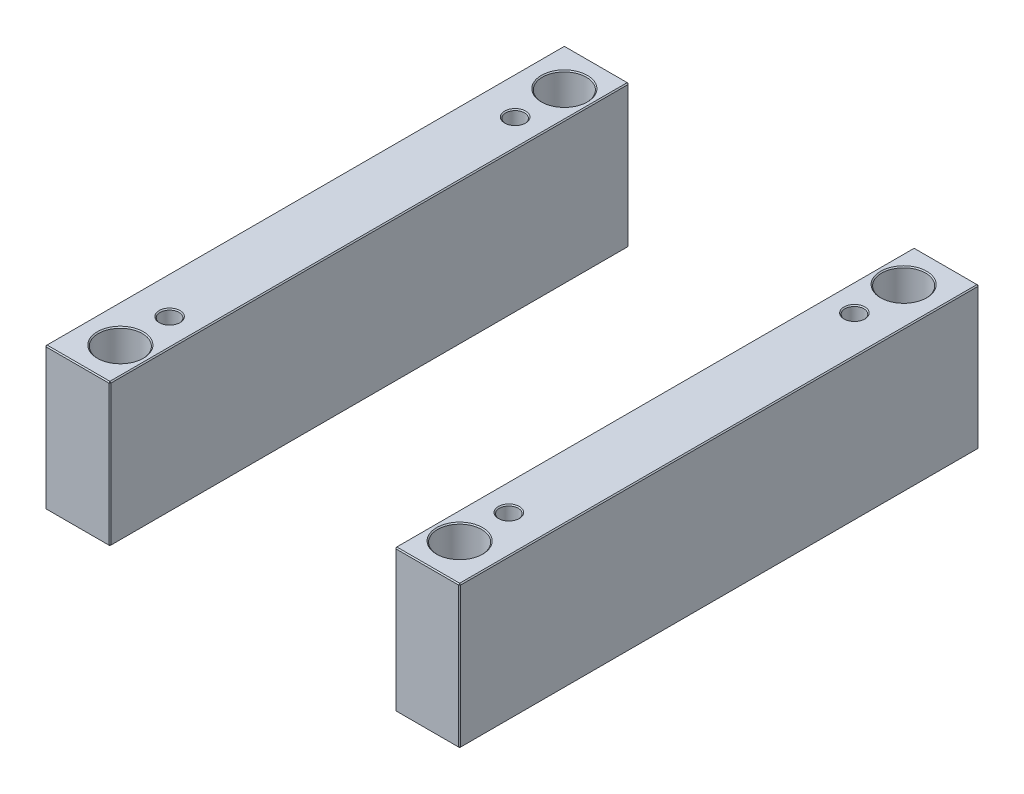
ISO-10303-21;
HEADER;
FILE_DESCRIPTION(('STEP AP214'),'2;1');
FILE_NAME('part.step','',(''),(''),'','','');
FILE_SCHEMA(('AUTOMOTIVE_DESIGN { 1 0 10303 214 1 1 1 1 }'));
ENDSEC;
DATA;
#1=APPLICATION_CONTEXT('core data for automotive mechanical design processes');
#2=APPLICATION_PROTOCOL_DEFINITION('international standard','automotive_design',2000,#1);
#3=PRODUCT_CONTEXT('',#1,'mechanical');
#4=PRODUCT('Part','Part','',(#3));
#5=PRODUCT_RELATED_PRODUCT_CATEGORY('part','',(#4));
#6=PRODUCT_DEFINITION_FORMATION('','',#4);
#7=PRODUCT_DEFINITION_CONTEXT('part definition',#1,'design');
#8=PRODUCT_DEFINITION('design','',#6,#7);
#9=PRODUCT_DEFINITION_SHAPE('','',#8);
#10=(LENGTH_UNIT() NAMED_UNIT(*) SI_UNIT(.MILLI.,.METRE.));
#11=(NAMED_UNIT(*) PLANE_ANGLE_UNIT() SI_UNIT($,.RADIAN.));
#12=(NAMED_UNIT(*) SI_UNIT($,.STERADIAN.) SOLID_ANGLE_UNIT());
#13=UNCERTAINTY_MEASURE_WITH_UNIT(LENGTH_MEASURE(1.E-05),#10,'distance_accuracy_value','');
#14=(GEOMETRIC_REPRESENTATION_CONTEXT(3) GLOBAL_UNCERTAINTY_ASSIGNED_CONTEXT((#13)) GLOBAL_UNIT_ASSIGNED_CONTEXT((#10,
#11,#12)) REPRESENTATION_CONTEXT('',''));
#15=CARTESIAN_POINT('',(0.,0.,0.));
#16=DIRECTION('',(0.,0.,1.));
#17=DIRECTION('',(1.,0.,0.));
#18=AXIS2_PLACEMENT_3D('',#15,#16,#17);
#19=CARTESIAN_POINT('',(-198.,136.,-248.));
#20=DIRECTION('',(0.,0.,1.));
#21=DIRECTION('',(1.,0.,0.));
#22=AXIS2_PLACEMENT_3D('',#19,#20,#21);
#23=PLANE('',#22);
#24=DIRECTION('',(-1.,0.,0.));
#25=VECTOR('',#24,1.);
#26=CARTESIAN_POINT('',(-198.,1.,-248.));
#27=LINE('',#26,#25);
#28=CARTESIAN_POINT('',(-137.,1.,-248.));
#29=VERTEX_POINT('',#28);
#30=CARTESIAN_POINT('',(-197.,1.,-248.));
#31=VERTEX_POINT('',#30);
#32=EDGE_CURVE('P0_E137',#29,#31,#27,.T.);
#33=ORIENTED_EDGE('',*,*,#32,.T.);
#34=DIRECTION('',(0.,1.,0.));
#35=VECTOR('',#34,1.);
#36=CARTESIAN_POINT('',(-197.,136.,-248.));
#37=LINE('',#36,#35);
#38=CARTESIAN_POINT('',(-197.,135.,-248.));
#39=VERTEX_POINT('',#38);
#40=EDGE_CURVE('P0_E265',#31,#39,#37,.T.);
#41=ORIENTED_EDGE('',*,*,#40,.T.);
#42=DIRECTION('',(1.,0.,0.));
#43=VECTOR('',#42,1.);
#44=CARTESIAN_POINT('',(-198.,135.,-248.));
#45=LINE('',#44,#43);
#46=CARTESIAN_POINT('',(-137.,135.,-248.));
#47=VERTEX_POINT('',#46);
#48=EDGE_CURVE('P0_E263',#39,#47,#45,.T.);
#49=ORIENTED_EDGE('',*,*,#48,.T.);
#50=DIRECTION('',(0.,-1.,0.));
#51=VECTOR('',#50,1.);
#52=CARTESIAN_POINT('',(-137.,136.,-248.));
#53=LINE('',#52,#51);
#54=EDGE_CURVE('P0_E260',#47,#29,#53,.T.);
#55=ORIENTED_EDGE('',*,*,#54,.T.);
#56=EDGE_LOOP('',(#33,#41,#49,#55));
#57=FACE_BOUND('',#56,.T.);
#58=ADVANCED_FACE('P0_F16',(#57),#23,.F.);
#59=CARTESIAN_POINT('',(-198.,136.,248.));
#60=DIRECTION('',(1.,0.,0.));
#61=DIRECTION('',(0.,0.,-1.));
#62=AXIS2_PLACEMENT_3D('',#59,#60,#61);
#63=PLANE('',#62);
#64=DIRECTION('',(0.,1.,0.));
#65=VECTOR('',#64,1.);
#66=CARTESIAN_POINT('',(-198.,136.,247.));
#67=LINE('',#66,#65);
#68=CARTESIAN_POINT('',(-198.,1.,247.));
#69=VERTEX_POINT('',#68);
#70=CARTESIAN_POINT('',(-198.,135.,247.));
#71=VERTEX_POINT('',#70);
#72=EDGE_CURVE('P0_E253',#69,#71,#67,.T.);
#73=ORIENTED_EDGE('',*,*,#72,.T.);
#74=DIRECTION('',(0.,0.,-1.));
#75=VECTOR('',#74,1.);
#76=CARTESIAN_POINT('',(-198.,135.,248.));
#77=LINE('',#76,#75);
#78=CARTESIAN_POINT('',(-198.,135.,-247.));
#79=VERTEX_POINT('',#78);
#80=EDGE_CURVE('P0_E258',#71,#79,#77,.T.);
#81=ORIENTED_EDGE('',*,*,#80,.T.);
#82=DIRECTION('',(0.,-1.,0.));
#83=VECTOR('',#82,1.);
#84=CARTESIAN_POINT('',(-198.,136.,-247.));
#85=LINE('',#84,#83);
#86=CARTESIAN_POINT('',(-198.,1.,-247.));
#87=VERTEX_POINT('',#86);
#88=EDGE_CURVE('P0_E255',#79,#87,#85,.T.);
#89=ORIENTED_EDGE('',*,*,#88,.T.);
#90=DIRECTION('',(0.,0.,1.));
#91=VECTOR('',#90,1.);
#92=CARTESIAN_POINT('',(-198.,1.,248.));
#93=LINE('',#92,#91);
#94=EDGE_CURVE('P0_E251',#87,#69,#93,.T.);
#95=ORIENTED_EDGE('',*,*,#94,.T.);
#96=EDGE_LOOP('',(#73,#81,#89,#95));
#97=FACE_BOUND('',#96,.T.);
#98=ADVANCED_FACE('P0_F333',(#97),#63,.F.);
#99=CARTESIAN_POINT('',(-198.,136.,248.));
#100=DIRECTION('',(0.,0.,-1.));
#101=DIRECTION('',(-1.,0.,0.));
#102=AXIS2_PLACEMENT_3D('',#99,#100,#101);
#103=PLANE('',#102);
#104=DIRECTION('',(-1.,0.,0.));
#105=VECTOR('',#104,1.);
#106=CARTESIAN_POINT('',(-198.,135.,248.));
#107=LINE('',#106,#105);
#108=CARTESIAN_POINT('',(-137.,135.,248.));
#109=VERTEX_POINT('',#108);
#110=CARTESIAN_POINT('',(-197.,135.,248.));
#111=VERTEX_POINT('',#110);
#112=EDGE_CURVE('P0_E272',#109,#111,#107,.T.);
#113=ORIENTED_EDGE('',*,*,#112,.T.);
#114=DIRECTION('',(0.,-1.,0.));
#115=VECTOR('',#114,1.);
#116=CARTESIAN_POINT('',(-197.,136.,248.));
#117=LINE('',#116,#115);
#118=CARTESIAN_POINT('',(-197.,1.,248.));
#119=VERTEX_POINT('',#118);
#120=EDGE_CURVE('P0_E274',#111,#119,#117,.T.);
#121=ORIENTED_EDGE('',*,*,#120,.T.);
#122=DIRECTION('',(1.,0.,0.));
#123=VECTOR('',#122,1.);
#124=CARTESIAN_POINT('',(-136.,1.,248.));
#125=LINE('',#124,#123);
#126=CARTESIAN_POINT('',(-137.,1.,248.));
#127=VERTEX_POINT('',#126);
#128=EDGE_CURVE('P0_E270',#119,#127,#125,.T.);
#129=ORIENTED_EDGE('',*,*,#128,.T.);
#130=DIRECTION('',(0.,1.,0.));
#131=VECTOR('',#130,1.);
#132=CARTESIAN_POINT('',(-137.,136.,248.));
#133=LINE('',#132,#131);
#134=EDGE_CURVE('P0_E268',#127,#109,#133,.T.);
#135=ORIENTED_EDGE('',*,*,#134,.T.);
#136=EDGE_LOOP('',(#113,#121,#129,#135));
#137=FACE_BOUND('',#136,.T.);
#138=ADVANCED_FACE('P0_F372',(#137),#103,.F.);
#139=CARTESIAN_POINT('',(-136.,136.,-248.));
#140=DIRECTION('',(-1.,0.,0.));
#141=DIRECTION('',(0.,0.,1.));
#142=AXIS2_PLACEMENT_3D('',#139,#140,#141);
#143=PLANE('',#142);
#144=DIRECTION('',(0.,0.,1.));
#145=VECTOR('',#144,1.);
#146=CARTESIAN_POINT('',(-136.,135.,-248.));
#147=LINE('',#146,#145);
#148=CARTESIAN_POINT('',(-136.,135.,-247.));
#149=VERTEX_POINT('',#148);
#150=CARTESIAN_POINT('',(-136.,135.,247.));
#151=VERTEX_POINT('',#150);
#152=EDGE_CURVE('P0_E31',#149,#151,#147,.T.);
#153=ORIENTED_EDGE('',*,*,#152,.T.);
#154=DIRECTION('',(0.,-1.,0.));
#155=VECTOR('',#154,1.);
#156=CARTESIAN_POINT('',(-136.,136.,247.));
#157=LINE('',#156,#155);
#158=CARTESIAN_POINT('',(-136.,1.,247.));
#159=VERTEX_POINT('',#158);
#160=EDGE_CURVE('P0_E190',#151,#159,#157,.T.);
#161=ORIENTED_EDGE('',*,*,#160,.T.);
#162=DIRECTION('',(0.,0.,-1.));
#163=VECTOR('',#162,1.);
#164=CARTESIAN_POINT('',(-136.,1.,-248.));
#165=LINE('',#164,#163);
#166=CARTESIAN_POINT('',(-136.,1.,-247.));
#167=VERTEX_POINT('',#166);
#168=EDGE_CURVE('P0_E286',#159,#167,#165,.T.);
#169=ORIENTED_EDGE('',*,*,#168,.T.);
#170=DIRECTION('',(0.,1.,0.));
#171=VECTOR('',#170,1.);
#172=CARTESIAN_POINT('',(-136.,136.,-247.));
#173=LINE('',#172,#171);
#174=EDGE_CURVE('P0_E36',#167,#149,#173,.T.);
#175=ORIENTED_EDGE('',*,*,#174,.T.);
#176=EDGE_LOOP('',(#153,#161,#169,#175));
#177=FACE_BOUND('',#176,.T.);
#178=ADVANCED_FACE('P0_F649',(#177),#143,.F.);
#179=CARTESIAN_POINT('',(0.,136.,0.));
#180=DIRECTION('',(0.,-1.,0.));
#181=DIRECTION('',(0.,0.,-1.));
#182=AXIS2_PLACEMENT_3D('',#179,#180,#181);
#183=PLANE('',#182);
#184=CARTESIAN_POINT('',(-162.,136.,-212.));
#185=DIRECTION('',(0.,-1.,0.));
#186=DIRECTION('',(0.,0.,-1.));
#187=AXIS2_PLACEMENT_3D('',#184,#185,#186);
#188=CIRCLE('',#187,22.);
#189=CARTESIAN_POINT('',(-162.,136.,-234.));
#190=VERTEX_POINT('',#189);
#191=EDGE_CURVE('P0_E214',#190,#190,#188,.T.);
#192=ORIENTED_EDGE('',*,*,#191,.T.);
#193=EDGE_LOOP('',(#192));
#194=FACE_BOUND('',#193,.T.);
#195=CARTESIAN_POINT('',(-162.,136.,212.));
#196=DIRECTION('',(0.,-1.,0.));
#197=DIRECTION('',(0.,0.,-1.));
#198=AXIS2_PLACEMENT_3D('',#195,#196,#197);
#199=CIRCLE('',#198,22.);
#200=CARTESIAN_POINT('',(-162.,136.,190.));
#201=VERTEX_POINT('',#200);
#202=EDGE_CURVE('P0_E211',#201,#201,#199,.T.);
#203=ORIENTED_EDGE('',*,*,#202,.T.);
#204=EDGE_LOOP('',(#203));
#205=FACE_BOUND('',#204,.T.);
#206=CARTESIAN_POINT('',(-162.,136.,165.));
#207=DIRECTION('',(0.,-1.,0.));
#208=DIRECTION('',(0.,0.,-1.));
#209=AXIS2_PLACEMENT_3D('',#206,#207,#208);
#210=CIRCLE('',#209,10.);
#211=CARTESIAN_POINT('',(-162.,136.,155.));
#212=VERTEX_POINT('',#211);
#213=EDGE_CURVE('P0_E193',#212,#212,#210,.T.);
#214=ORIENTED_EDGE('',*,*,#213,.T.);
#215=EDGE_LOOP('',(#214));
#216=FACE_BOUND('',#215,.T.);
#217=CARTESIAN_POINT('',(-162.,136.,-165.));
#218=DIRECTION('',(0.,-1.,0.));
#219=DIRECTION('',(0.,0.,-1.));
#220=AXIS2_PLACEMENT_3D('',#217,#218,#219);
#221=CIRCLE('',#220,10.);
#222=CARTESIAN_POINT('',(-162.,136.,-175.));
#223=VERTEX_POINT('',#222);
#224=EDGE_CURVE('P0_E189',#223,#223,#221,.T.);
#225=ORIENTED_EDGE('',*,*,#224,.T.);
#226=EDGE_LOOP('',(#225));
#227=FACE_BOUND('',#226,.T.);
#228=DIRECTION('',(0.,0.,1.));
#229=VECTOR('',#228,1.);
#230=CARTESIAN_POINT('',(-197.,136.,0.));
#231=LINE('',#230,#229);
#232=CARTESIAN_POINT('',(-197.,136.,-247.));
#233=VERTEX_POINT('',#232);
#234=CARTESIAN_POINT('',(-197.,136.,247.));
#235=VERTEX_POINT('',#234);
#236=EDGE_CURVE('P0_E281',#233,#235,#231,.T.);
#237=ORIENTED_EDGE('',*,*,#236,.T.);
#238=DIRECTION('',(1.,0.,0.));
#239=VECTOR('',#238,1.);
#240=CARTESIAN_POINT('',(0.,136.,247.));
#241=LINE('',#240,#239);
#242=CARTESIAN_POINT('',(-137.,136.,247.));
#243=VERTEX_POINT('',#242);
#244=EDGE_CURVE('P0_E283',#235,#243,#241,.T.);
#245=ORIENTED_EDGE('',*,*,#244,.T.);
#246=DIRECTION('',(0.,0.,-1.));
#247=VECTOR('',#246,1.);
#248=CARTESIAN_POINT('',(-137.,136.,0.));
#249=LINE('',#248,#247);
#250=CARTESIAN_POINT('',(-137.,136.,-247.));
#251=VERTEX_POINT('',#250);
#252=EDGE_CURVE('P0_E277',#243,#251,#249,.T.);
#253=ORIENTED_EDGE('',*,*,#252,.T.);
#254=DIRECTION('',(-1.,0.,0.));
#255=VECTOR('',#254,1.);
#256=CARTESIAN_POINT('',(0.,136.,-247.));
#257=LINE('',#256,#255);
#258=EDGE_CURVE('P0_E279',#251,#233,#257,.T.);
#259=ORIENTED_EDGE('',*,*,#258,.T.);
#260=EDGE_LOOP('',(#237,#245,#253,#259));
#261=FACE_BOUND('',#260,.T.);
#262=ADVANCED_FACE('P0_F229',(#194,#205,#216,#227,#261),#183,.F.);
#263=CARTESIAN_POINT('',(0.,0.,0.));
#264=DIRECTION('',(0.,-1.,0.));
#265=DIRECTION('',(0.,0.,-1.));
#266=AXIS2_PLACEMENT_3D('',#263,#264,#265);
#267=PLANE('',#266);
#268=CARTESIAN_POINT('',(-162.,0.,-212.));
#269=DIRECTION('',(0.,-1.,0.));
#270=DIRECTION('',(0.,0.,-1.));
#271=AXIS2_PLACEMENT_3D('',#268,#269,#270);
#272=CIRCLE('',#271,22.);
#273=CARTESIAN_POINT('',(-162.,0.,-234.));
#274=VERTEX_POINT('',#273);
#275=EDGE_CURVE('P0_E202',#274,#274,#272,.F.);
#276=ORIENTED_EDGE('',*,*,#275,.T.);
#277=EDGE_LOOP('',(#276));
#278=FACE_BOUND('',#277,.T.);
#279=CARTESIAN_POINT('',(-162.,0.,212.));
#280=DIRECTION('',(0.,-1.,0.));
#281=DIRECTION('',(0.,0.,-1.));
#282=AXIS2_PLACEMENT_3D('',#279,#280,#281);
#283=CIRCLE('',#282,22.);
#284=CARTESIAN_POINT('',(-162.,0.,190.));
#285=VERTEX_POINT('',#284);
#286=EDGE_CURVE('P0_E199',#285,#285,#283,.F.);
#287=ORIENTED_EDGE('',*,*,#286,.T.);
#288=EDGE_LOOP('',(#287));
#289=FACE_BOUND('',#288,.T.);
#290=CARTESIAN_POINT('',(-162.,0.,-165.));
#291=DIRECTION('',(0.,-1.,0.));
#292=DIRECTION('',(0.,0.,-1.));
#293=AXIS2_PLACEMENT_3D('',#290,#291,#292);
#294=CIRCLE('',#293,10.);
#295=CARTESIAN_POINT('',(-162.,0.,-175.));
#296=VERTEX_POINT('',#295);
#297=EDGE_CURVE('P0_E235',#296,#296,#294,.F.);
#298=ORIENTED_EDGE('',*,*,#297,.T.);
#299=EDGE_LOOP('',(#298));
#300=FACE_BOUND('',#299,.T.);
#301=CARTESIAN_POINT('',(-162.,0.,165.));
#302=DIRECTION('',(0.,-1.,0.));
#303=DIRECTION('',(0.,0.,-1.));
#304=AXIS2_PLACEMENT_3D('',#301,#302,#303);
#305=CIRCLE('',#304,10.);
#306=CARTESIAN_POINT('',(-162.,0.,155.));
#307=VERTEX_POINT('',#306);
#308=EDGE_CURVE('P0_E238',#307,#307,#305,.F.);
#309=ORIENTED_EDGE('',*,*,#308,.T.);
#310=EDGE_LOOP('',(#309));
#311=FACE_BOUND('',#310,.T.);
#312=DIRECTION('',(-1.,0.,0.));
#313=VECTOR('',#312,1.);
#314=CARTESIAN_POINT('',(-198.,0.,247.));
#315=LINE('',#314,#313);
#316=CARTESIAN_POINT('',(-137.,0.,247.));
#317=VERTEX_POINT('',#316);
#318=CARTESIAN_POINT('',(-197.,0.,247.));
#319=VERTEX_POINT('',#318);
#320=EDGE_CURVE('P0_E114',#317,#319,#315,.T.);
#321=ORIENTED_EDGE('',*,*,#320,.T.);
#322=DIRECTION('',(0.,0.,-1.));
#323=VECTOR('',#322,1.);
#324=CARTESIAN_POINT('',(-197.,0.,-248.));
#325=LINE('',#324,#323);
#326=CARTESIAN_POINT('',(-197.,0.,-247.));
#327=VERTEX_POINT('',#326);
#328=EDGE_CURVE('P0_E110',#319,#327,#325,.T.);
#329=ORIENTED_EDGE('',*,*,#328,.T.);
#330=DIRECTION('',(1.,0.,0.));
#331=VECTOR('',#330,1.);
#332=CARTESIAN_POINT('',(-136.,0.,-247.));
#333=LINE('',#332,#331);
#334=CARTESIAN_POINT('',(-137.,0.,-247.));
#335=VERTEX_POINT('',#334);
#336=EDGE_CURVE('P0_E104',#327,#335,#333,.T.);
#337=ORIENTED_EDGE('',*,*,#336,.T.);
#338=DIRECTION('',(0.,0.,1.));
#339=VECTOR('',#338,1.);
#340=CARTESIAN_POINT('',(-137.,0.,248.));
#341=LINE('',#340,#339);
#342=EDGE_CURVE('P0_E107',#335,#317,#341,.T.);
#343=ORIENTED_EDGE('',*,*,#342,.T.);
#344=EDGE_LOOP('',(#321,#329,#337,#343));
#345=FACE_BOUND('',#344,.T.);
#346=ADVANCED_FACE('P0_F106',(#278,#289,#300,#311,#345),#267,.T.);
#347=CARTESIAN_POINT('',(-162.,0.,-165.));
#348=DIRECTION('',(0.,1.,0.));
#349=DIRECTION('',(0.,0.,1.));
#350=AXIS2_PLACEMENT_3D('',#347,#348,#349);
#351=CYLINDRICAL_SURFACE('',#350,9.);
#352=CARTESIAN_POINT('',(-162.,135.,-165.));
#353=DIRECTION('',(0.,-1.,0.));
#354=DIRECTION('',(0.,0.,-1.));
#355=AXIS2_PLACEMENT_3D('',#352,#353,#354);
#356=CIRCLE('',#355,9.);
#357=CARTESIAN_POINT('',(-162.,135.,-174.));
#358=VERTEX_POINT('',#357);
#359=EDGE_CURVE('P0_E196',#358,#358,#356,.F.);
#360=ORIENTED_EDGE('',*,*,#359,.T.);
#361=EDGE_LOOP('',(#360));
#362=FACE_BOUND('',#361,.T.);
#363=CARTESIAN_POINT('',(-162.,0.999999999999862,-165.));
#364=DIRECTION('',(0.,-1.,0.));
#365=DIRECTION('',(0.,0.,-1.));
#366=AXIS2_PLACEMENT_3D('',#363,#364,#365);
#367=CIRCLE('',#366,9.);
#368=CARTESIAN_POINT('',(-162.,0.999999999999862,-174.));
#369=VERTEX_POINT('',#368);
#370=EDGE_CURVE('P0_E241',#369,#369,#367,.T.);
#371=ORIENTED_EDGE('',*,*,#370,.T.);
#372=EDGE_LOOP('',(#371));
#373=FACE_BOUND('',#372,.T.);
#374=ADVANCED_FACE('P0_F228',(#362,#373),#351,.F.);
#375=CARTESIAN_POINT('',(-162.,0.,165.));
#376=DIRECTION('',(0.,1.,0.));
#377=DIRECTION('',(0.,0.,1.));
#378=AXIS2_PLACEMENT_3D('',#375,#376,#377);
#379=CYLINDRICAL_SURFACE('',#378,9.);
#380=CARTESIAN_POINT('',(-162.,135.,165.));
#381=DIRECTION('',(0.,-1.,0.));
#382=DIRECTION('',(0.,0.,-1.));
#383=AXIS2_PLACEMENT_3D('',#380,#381,#382);
#384=CIRCLE('',#383,9.);
#385=CARTESIAN_POINT('',(-162.,135.,156.));
#386=VERTEX_POINT('',#385);
#387=EDGE_CURVE('P0_E186',#386,#386,#384,.F.);
#388=ORIENTED_EDGE('',*,*,#387,.T.);
#389=EDGE_LOOP('',(#388));
#390=FACE_BOUND('',#389,.T.);
#391=CARTESIAN_POINT('',(-162.,0.999999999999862,165.));
#392=DIRECTION('',(0.,-1.,0.));
#393=DIRECTION('',(0.,0.,-1.));
#394=AXIS2_PLACEMENT_3D('',#391,#392,#393);
#395=CIRCLE('',#394,9.);
#396=CARTESIAN_POINT('',(-162.,0.999999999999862,156.));
#397=VERTEX_POINT('',#396);
#398=EDGE_CURVE('P0_E248',#397,#397,#395,.T.);
#399=ORIENTED_EDGE('',*,*,#398,.T.);
#400=EDGE_LOOP('',(#399));
#401=FACE_BOUND('',#400,.T.);
#402=ADVANCED_FACE('P0_F380',(#390,#401),#379,.F.);
#403=CARTESIAN_POINT('',(-162.,0.,-165.));
#404=DIRECTION('',(0.,-1.,0.));
#405=DIRECTION('',(0.,0.,-1.));
#406=AXIS2_PLACEMENT_3D('',#403,#404,#405);
#407=CONICAL_SURFACE('',#406,10.,0.78539816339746);
#408=ORIENTED_EDGE('',*,*,#370,.F.);
#409=EDGE_LOOP('',(#408));
#410=FACE_BOUND('',#409,.T.);
#411=ORIENTED_EDGE('',*,*,#297,.F.);
#412=EDGE_LOOP('',(#411));
#413=FACE_BOUND('',#412,.T.);
#414=ADVANCED_FACE('P0_F376',(#410,#413),#407,.F.);
#415=CARTESIAN_POINT('',(-162.,0.,165.));
#416=DIRECTION('',(0.,-1.,0.));
#417=DIRECTION('',(0.,0.,-1.));
#418=AXIS2_PLACEMENT_3D('',#415,#416,#417);
#419=CONICAL_SURFACE('',#418,10.,0.78539816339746);
#420=ORIENTED_EDGE('',*,*,#398,.F.);
#421=EDGE_LOOP('',(#420));
#422=FACE_BOUND('',#421,.T.);
#423=ORIENTED_EDGE('',*,*,#308,.F.);
#424=EDGE_LOOP('',(#423));
#425=FACE_BOUND('',#424,.T.);
#426=ADVANCED_FACE('P0_F379',(#422,#425),#419,.F.);
#427=CARTESIAN_POINT('',(-136.,136.,247.));
#428=DIRECTION('',(-0.707106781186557,0.,-0.707106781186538));
#429=DIRECTION('',(0.,-1.,0.));
#430=AXIS2_PLACEMENT_3D('',#427,#428,#429);
#431=PLANE('',#430);
#432=DIRECTION('',(-0.707106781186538,0.,0.707106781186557));
#433=VECTOR('',#432,1.);
#434=CARTESIAN_POINT('',(-136.5,135.,247.5));
#435=LINE('',#434,#433);
#436=EDGE_CURVE('P0_E125',#109,#151,#435,.F.);
#437=ORIENTED_EDGE('',*,*,#436,.F.);
#438=ORIENTED_EDGE('',*,*,#134,.F.);
#439=DIRECTION('',(0.707106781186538,0.,-0.707106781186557));
#440=VECTOR('',#439,1.);
#441=CARTESIAN_POINT('',(-137.,1.,248.));
#442=LINE('',#441,#440);
#443=EDGE_CURVE('P0_E181',#159,#127,#442,.F.);
#444=ORIENTED_EDGE('',*,*,#443,.F.);
#445=ORIENTED_EDGE('',*,*,#160,.F.);
#446=EDGE_LOOP('',(#437,#438,#444,#445));
#447=FACE_BOUND('',#446,.T.);
#448=ADVANCED_FACE('P0_F384',(#447),#431,.F.);
#449=CARTESIAN_POINT('',(-137.,136.,247.));
#450=DIRECTION('',(0.577350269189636,0.57735026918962,0.57735026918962));
#451=DIRECTION('',(0.707106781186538,0.,-0.707106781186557));
#452=AXIS2_PLACEMENT_3D('',#449,#450,#451);
#453=PLANE('',#452);
#454=DIRECTION('',(0.,0.707106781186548,-0.707106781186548));
#455=VECTOR('',#454,1.);
#456=CARTESIAN_POINT('',(-137.,136.,247.));
#457=LINE('',#456,#455);
#458=EDGE_CURVE('P0_E175',#109,#243,#457,.T.);
#459=ORIENTED_EDGE('',*,*,#458,.F.);
#460=ORIENTED_EDGE('',*,*,#436,.T.);
#461=DIRECTION('',(0.707106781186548,-0.707106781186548,0.));
#462=VECTOR('',#461,1.);
#463=CARTESIAN_POINT('',(-137.,136.,247.));
#464=LINE('',#463,#462);
#465=EDGE_CURVE('P0_E178',#243,#151,#464,.T.);
#466=ORIENTED_EDGE('',*,*,#465,.F.);
#467=EDGE_LOOP('',(#459,#460,#466));
#468=FACE_BOUND('',#467,.T.);
#469=ADVANCED_FACE('P0_F588',(#468),#453,.T.);
#470=CARTESIAN_POINT('',(-137.,1.,248.));
#471=DIRECTION('',(0.577350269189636,-0.57735026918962,0.57735026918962));
#472=DIRECTION('',(0.707106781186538,0.,-0.707106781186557));
#473=AXIS2_PLACEMENT_3D('',#470,#471,#472);
#474=PLANE('',#473);
#475=DIRECTION('',(0.707106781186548,0.707106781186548,0.));
#476=VECTOR('',#475,1.);
#477=CARTESIAN_POINT('',(-136.5,0.499999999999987,247.));
#478=LINE('',#477,#476);
#479=EDGE_CURVE('P0_E123',#159,#317,#478,.F.);
#480=ORIENTED_EDGE('',*,*,#479,.F.);
#481=ORIENTED_EDGE('',*,*,#443,.T.);
#482=DIRECTION('',(0.,-0.707106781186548,-0.707106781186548));
#483=VECTOR('',#482,1.);
#484=CARTESIAN_POINT('',(-137.,1.,248.));
#485=LINE('',#484,#483);
#486=EDGE_CURVE('P0_E172',#317,#127,#485,.F.);
#487=ORIENTED_EDGE('',*,*,#486,.F.);
#488=EDGE_LOOP('',(#480,#481,#487));
#489=FACE_BOUND('',#488,.T.);
#490=ADVANCED_FACE('P0_F597',(#489),#474,.T.);
#491=CARTESIAN_POINT('',(-137.,136.,0.));
#492=DIRECTION('',(-0.707106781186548,-0.707106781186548,0.));
#493=DIRECTION('',(0.,0.,-1.));
#494=AXIS2_PLACEMENT_3D('',#491,#492,#493);
#495=PLANE('',#494);
#496=ORIENTED_EDGE('',*,*,#465,.T.);
#497=ORIENTED_EDGE('',*,*,#152,.F.);
#498=DIRECTION('',(-0.707106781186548,0.707106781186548,0.));
#499=VECTOR('',#498,1.);
#500=CARTESIAN_POINT('',(-136.5,135.5,-247.));
#501=LINE('',#500,#499);
#502=EDGE_CURVE('P0_E165',#251,#149,#501,.F.);
#503=ORIENTED_EDGE('',*,*,#502,.F.);
#504=ORIENTED_EDGE('',*,*,#252,.F.);
#505=EDGE_LOOP('',(#496,#497,#503,#504));
#506=FACE_BOUND('',#505,.T.);
#507=ADVANCED_FACE('P0_F349',(#506),#495,.F.);
#508=CARTESIAN_POINT('',(0.,136.,247.));
#509=DIRECTION('',(0.,-0.707106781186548,-0.707106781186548));
#510=DIRECTION('',(1.,0.,0.));
#511=AXIS2_PLACEMENT_3D('',#508,#509,#510);
#512=PLANE('',#511);
#513=ORIENTED_EDGE('',*,*,#458,.T.);
#514=ORIENTED_EDGE('',*,*,#244,.F.);
#515=DIRECTION('',(0.,-0.707106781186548,0.707106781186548));
#516=VECTOR('',#515,1.);
#517=CARTESIAN_POINT('',(-197.,135.5,247.5));
#518=LINE('',#517,#516);
#519=EDGE_CURVE('P0_E162',#111,#235,#518,.F.);
#520=ORIENTED_EDGE('',*,*,#519,.F.);
#521=ORIENTED_EDGE('',*,*,#112,.F.);
#522=EDGE_LOOP('',(#513,#514,#520,#521));
#523=FACE_BOUND('',#522,.T.);
#524=ADVANCED_FACE('P0_F344',(#523),#512,.F.);
#525=CARTESIAN_POINT('',(-197.,136.,248.));
#526=DIRECTION('',(0.707106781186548,0.,-0.707106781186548));
#527=DIRECTION('',(0.,-1.,0.));
#528=AXIS2_PLACEMENT_3D('',#525,#526,#527);
#529=PLANE('',#528);
#530=DIRECTION('',(0.707106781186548,0.,0.707106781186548));
#531=VECTOR('',#530,1.);
#532=CARTESIAN_POINT('',(-197.,1.,248.));
#533=LINE('',#532,#531);
#534=EDGE_CURVE('P0_E156',#119,#69,#533,.F.);
#535=ORIENTED_EDGE('',*,*,#534,.F.);
#536=ORIENTED_EDGE('',*,*,#120,.F.);
#537=DIRECTION('',(-0.707106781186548,0.,-0.707106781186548));
#538=VECTOR('',#537,1.);
#539=CARTESIAN_POINT('',(-198.,135.,247.));
#540=LINE('',#539,#538);
#541=EDGE_CURVE('P0_E159',#71,#111,#540,.F.);
#542=ORIENTED_EDGE('',*,*,#541,.F.);
#543=ORIENTED_EDGE('',*,*,#72,.F.);
#544=EDGE_LOOP('',(#535,#536,#542,#543));
#545=FACE_BOUND('',#544,.T.);
#546=ADVANCED_FACE('P0_F338',(#545),#529,.F.);
#547=CARTESIAN_POINT('',(-198.,1.,248.));
#548=DIRECTION('',(0.,-0.707106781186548,0.707106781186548));
#549=DIRECTION('',(-1.,0.,0.));
#550=AXIS2_PLACEMENT_3D('',#547,#548,#549);
#551=PLANE('',#550);
#552=ORIENTED_EDGE('',*,*,#486,.T.);
#553=ORIENTED_EDGE('',*,*,#128,.F.);
#554=DIRECTION('',(0.,0.707106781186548,0.707106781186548));
#555=VECTOR('',#554,1.);
#556=CARTESIAN_POINT('',(-197.,1.,248.));
#557=LINE('',#556,#555);
#558=EDGE_CURVE('P0_E134',#319,#119,#557,.T.);
#559=ORIENTED_EDGE('',*,*,#558,.F.);
#560=ORIENTED_EDGE('',*,*,#320,.F.);
#561=EDGE_LOOP('',(#552,#553,#559,#560));
#562=FACE_BOUND('',#561,.T.);
#563=ADVANCED_FACE('P0_F364',(#562),#551,.T.);
#564=CARTESIAN_POINT('',(-136.,1.,-248.));
#565=DIRECTION('',(0.707106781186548,-0.707106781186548,0.));
#566=DIRECTION('',(0.,0.,1.));
#567=AXIS2_PLACEMENT_3D('',#564,#565,#566);
#568=PLANE('',#567);
#569=ORIENTED_EDGE('',*,*,#479,.T.);
#570=ORIENTED_EDGE('',*,*,#342,.F.);
#571=DIRECTION('',(-0.707106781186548,-0.707106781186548,0.));
#572=VECTOR('',#571,1.);
#573=CARTESIAN_POINT('',(-137.,0.,-247.));
#574=LINE('',#573,#572);
#575=EDGE_CURVE('P0_E120',#167,#335,#574,.T.);
#576=ORIENTED_EDGE('',*,*,#575,.F.);
#577=ORIENTED_EDGE('',*,*,#168,.F.);
#578=EDGE_LOOP('',(#569,#570,#576,#577));
#579=FACE_BOUND('',#578,.T.);
#580=ADVANCED_FACE('P0_F119',(#579),#568,.T.);
#581=CARTESIAN_POINT('',(-137.,136.,-248.));
#582=DIRECTION('',(-0.707106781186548,0.,0.707106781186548));
#583=DIRECTION('',(0.,-1.,0.));
#584=AXIS2_PLACEMENT_3D('',#581,#582,#583);
#585=PLANE('',#584);
#586=DIRECTION('',(0.707106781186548,0.,0.707106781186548));
#587=VECTOR('',#586,1.);
#588=CARTESIAN_POINT('',(-137.,135.,-248.));
#589=LINE('',#588,#587);
#590=EDGE_CURVE('P0_E168',#149,#47,#589,.F.);
#591=ORIENTED_EDGE('',*,*,#590,.F.);
#592=ORIENTED_EDGE('',*,*,#174,.F.);
#593=DIRECTION('',(-0.707106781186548,0.,-0.707106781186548));
#594=VECTOR('',#593,1.);
#595=CARTESIAN_POINT('',(-136.5,1.,-247.5));
#596=LINE('',#595,#594);
#597=EDGE_CURVE('P0_E133',#29,#167,#596,.F.);
#598=ORIENTED_EDGE('',*,*,#597,.F.);
#599=ORIENTED_EDGE('',*,*,#54,.F.);
#600=EDGE_LOOP('',(#591,#592,#598,#599));
#601=FACE_BOUND('',#600,.T.);
#602=ADVANCED_FACE('P0_F354',(#601),#585,.F.);
#603=CARTESIAN_POINT('',(-137.,135.,-248.));
#604=DIRECTION('',(0.577350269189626,0.577350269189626,-0.577350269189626));
#605=DIRECTION('',(-0.707106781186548,0.,-0.707106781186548));
#606=AXIS2_PLACEMENT_3D('',#603,#604,#605);
#607=PLANE('',#606);
#608=ORIENTED_EDGE('',*,*,#502,.T.);
#609=ORIENTED_EDGE('',*,*,#590,.T.);
#610=DIRECTION('',(0.,-0.707106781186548,-0.707106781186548));
#611=VECTOR('',#610,1.);
#612=CARTESIAN_POINT('',(-137.,135.,-248.));
#613=LINE('',#612,#611);
#614=EDGE_CURVE('P0_E151',#251,#47,#613,.T.);
#615=ORIENTED_EDGE('',*,*,#614,.F.);
#616=EDGE_LOOP('',(#608,#609,#615));
#617=FACE_BOUND('',#616,.T.);
#618=ADVANCED_FACE('P0_F352',(#617),#607,.T.);
#619=CARTESIAN_POINT('',(-198.,135.,247.));
#620=DIRECTION('',(-0.577350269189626,0.577350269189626,0.577350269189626));
#621=DIRECTION('',(0.707106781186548,0.,0.707106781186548));
#622=AXIS2_PLACEMENT_3D('',#619,#620,#621);
#623=PLANE('',#622);
#624=ORIENTED_EDGE('',*,*,#541,.T.);
#625=ORIENTED_EDGE('',*,*,#519,.T.);
#626=DIRECTION('',(0.707106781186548,0.707106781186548,0.));
#627=VECTOR('',#626,1.);
#628=CARTESIAN_POINT('',(-198.,135.,247.));
#629=LINE('',#628,#627);
#630=EDGE_CURVE('P0_E142',#71,#235,#629,.T.);
#631=ORIENTED_EDGE('',*,*,#630,.F.);
#632=EDGE_LOOP('',(#624,#625,#631));
#633=FACE_BOUND('',#632,.T.);
#634=ADVANCED_FACE('P0_F341',(#633),#623,.T.);
#635=CARTESIAN_POINT('',(-197.,1.,248.));
#636=DIRECTION('',(-0.577350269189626,-0.577350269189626,0.577350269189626));
#637=DIRECTION('',(0.707106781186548,0.,0.707106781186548));
#638=AXIS2_PLACEMENT_3D('',#635,#636,#637);
#639=PLANE('',#638);
#640=ORIENTED_EDGE('',*,*,#558,.T.);
#641=ORIENTED_EDGE('',*,*,#534,.T.);
#642=DIRECTION('',(0.707106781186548,-0.707106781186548,0.));
#643=VECTOR('',#642,1.);
#644=CARTESIAN_POINT('',(-197.5,0.5,247.));
#645=LINE('',#644,#643);
#646=EDGE_CURVE('P0_E138',#319,#69,#645,.F.);
#647=ORIENTED_EDGE('',*,*,#646,.F.);
#648=EDGE_LOOP('',(#640,#641,#647));
#649=FACE_BOUND('',#648,.T.);
#650=ADVANCED_FACE('P0_F403',(#649),#639,.T.);
#651=CARTESIAN_POINT('',(-137.,0.,-247.));
#652=DIRECTION('',(0.577350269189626,-0.577350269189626,-0.577350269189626));
#653=DIRECTION('',(-0.707106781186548,0.,-0.707106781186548));
#654=AXIS2_PLACEMENT_3D('',#651,#652,#653);
#655=PLANE('',#654);
#656=ORIENTED_EDGE('',*,*,#597,.T.);
#657=ORIENTED_EDGE('',*,*,#575,.T.);
#658=DIRECTION('',(0.,0.707106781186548,-0.707106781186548));
#659=VECTOR('',#658,1.);
#660=CARTESIAN_POINT('',(-137.,0.,-247.));
#661=LINE('',#660,#659);
#662=EDGE_CURVE('P0_E130',#29,#335,#661,.F.);
#663=ORIENTED_EDGE('',*,*,#662,.F.);
#664=EDGE_LOOP('',(#656,#657,#663));
#665=FACE_BOUND('',#664,.T.);
#666=ADVANCED_FACE('P0_F129',(#665),#655,.T.);
#667=CARTESIAN_POINT('',(0.,136.,-247.));
#668=DIRECTION('',(0.,-0.707106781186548,0.707106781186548));
#669=DIRECTION('',(-1.,0.,0.));
#670=AXIS2_PLACEMENT_3D('',#667,#668,#669);
#671=PLANE('',#670);
#672=ORIENTED_EDGE('',*,*,#614,.T.);
#673=ORIENTED_EDGE('',*,*,#48,.F.);
#674=DIRECTION('',(0.,0.707106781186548,0.707106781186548));
#675=VECTOR('',#674,1.);
#676=CARTESIAN_POINT('',(-197.,135.,-248.));
#677=LINE('',#676,#675);
#678=EDGE_CURVE('P0_E139',#233,#39,#677,.F.);
#679=ORIENTED_EDGE('',*,*,#678,.F.);
#680=ORIENTED_EDGE('',*,*,#258,.F.);
#681=EDGE_LOOP('',(#672,#673,#679,#680));
#682=FACE_BOUND('',#681,.T.);
#683=ADVANCED_FACE('P0_F316',(#682),#671,.F.);
#684=CARTESIAN_POINT('',(-197.,136.,0.));
#685=DIRECTION('',(0.707106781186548,-0.707106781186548,0.));
#686=DIRECTION('',(0.,0.,1.));
#687=AXIS2_PLACEMENT_3D('',#684,#685,#686);
#688=PLANE('',#687);
#689=ORIENTED_EDGE('',*,*,#630,.T.);
#690=ORIENTED_EDGE('',*,*,#236,.F.);
#691=DIRECTION('',(-0.707106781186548,-0.707106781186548,0.));
#692=VECTOR('',#691,1.);
#693=CARTESIAN_POINT('',(-197.5,135.5,-247.));
#694=LINE('',#693,#692);
#695=EDGE_CURVE('P0_E145',#79,#233,#694,.F.);
#696=ORIENTED_EDGE('',*,*,#695,.F.);
#697=ORIENTED_EDGE('',*,*,#80,.F.);
#698=EDGE_LOOP('',(#689,#690,#696,#697));
#699=FACE_BOUND('',#698,.T.);
#700=ADVANCED_FACE('P0_F310',(#699),#688,.F.);
#701=CARTESIAN_POINT('',(-198.,1.,248.));
#702=DIRECTION('',(-0.707106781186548,-0.707106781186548,0.));
#703=DIRECTION('',(0.,0.,-1.));
#704=AXIS2_PLACEMENT_3D('',#701,#702,#703);
#705=PLANE('',#704);
#706=ORIENTED_EDGE('',*,*,#646,.T.);
#707=ORIENTED_EDGE('',*,*,#94,.F.);
#708=DIRECTION('',(-0.707106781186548,0.707106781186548,0.));
#709=VECTOR('',#708,1.);
#710=CARTESIAN_POINT('',(-198.,1.,-247.));
#711=LINE('',#710,#709);
#712=EDGE_CURVE('P0_E297',#327,#87,#711,.T.);
#713=ORIENTED_EDGE('',*,*,#712,.F.);
#714=ORIENTED_EDGE('',*,*,#328,.F.);
#715=EDGE_LOOP('',(#706,#707,#713,#714));
#716=FACE_BOUND('',#715,.T.);
#717=ADVANCED_FACE('P0_F329',(#716),#705,.T.);
#718=CARTESIAN_POINT('',(-198.,1.,-248.));
#719=DIRECTION('',(0.,-0.707106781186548,-0.707106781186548));
#720=DIRECTION('',(1.,0.,0.));
#721=AXIS2_PLACEMENT_3D('',#718,#719,#720);
#722=PLANE('',#721);
#723=ORIENTED_EDGE('',*,*,#662,.T.);
#724=ORIENTED_EDGE('',*,*,#336,.F.);
#725=DIRECTION('',(0.,-0.707106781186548,0.707106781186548));
#726=VECTOR('',#725,1.);
#727=CARTESIAN_POINT('',(-197.,0.499999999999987,-247.5));
#728=LINE('',#727,#726);
#729=EDGE_CURVE('P0_E295',#31,#327,#728,.T.);
#730=ORIENTED_EDGE('',*,*,#729,.F.);
#731=ORIENTED_EDGE('',*,*,#32,.F.);
#732=EDGE_LOOP('',(#723,#724,#730,#731));
#733=FACE_BOUND('',#732,.T.);
#734=ADVANCED_FACE('P0_F136',(#733),#722,.T.);
#735=CARTESIAN_POINT('',(-197.,135.,-248.));
#736=DIRECTION('',(-0.577350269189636,0.57735026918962,-0.57735026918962));
#737=DIRECTION('',(-0.707106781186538,0.,0.707106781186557));
#738=AXIS2_PLACEMENT_3D('',#735,#736,#737);
#739=PLANE('',#738);
#740=ORIENTED_EDGE('',*,*,#695,.T.);
#741=ORIENTED_EDGE('',*,*,#678,.T.);
#742=DIRECTION('',(0.707106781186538,0.,-0.707106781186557));
#743=VECTOR('',#742,1.);
#744=CARTESIAN_POINT('',(-197.,135.,-248.));
#745=LINE('',#744,#743);
#746=EDGE_CURVE('P0_E293',#79,#39,#745,.T.);
#747=ORIENTED_EDGE('',*,*,#746,.F.);
#748=EDGE_LOOP('',(#740,#741,#747));
#749=FACE_BOUND('',#748,.T.);
#750=ADVANCED_FACE('P0_F303',(#749),#739,.T.);
#751=CARTESIAN_POINT('',(-198.,1.,-247.));
#752=DIRECTION('',(-0.577350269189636,-0.57735026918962,-0.57735026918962));
#753=DIRECTION('',(-0.707106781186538,0.,0.707106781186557));
#754=AXIS2_PLACEMENT_3D('',#751,#752,#753);
#755=PLANE('',#754);
#756=ORIENTED_EDGE('',*,*,#729,.T.);
#757=ORIENTED_EDGE('',*,*,#712,.T.);
#758=DIRECTION('',(-0.707106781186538,0.,0.707106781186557));
#759=VECTOR('',#758,1.);
#760=CARTESIAN_POINT('',(-198.,1.,-247.));
#761=LINE('',#760,#759);
#762=EDGE_CURVE('P0_E291',#31,#87,#761,.T.);
#763=ORIENTED_EDGE('',*,*,#762,.F.);
#764=EDGE_LOOP('',(#756,#757,#763));
#765=FACE_BOUND('',#764,.T.);
#766=ADVANCED_FACE('P0_F325',(#765),#755,.T.);
#767=CARTESIAN_POINT('',(-198.,136.,-247.));
#768=DIRECTION('',(0.707106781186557,0.,0.707106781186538));
#769=DIRECTION('',(0.,-1.,0.));
#770=AXIS2_PLACEMENT_3D('',#767,#768,#769);
#771=PLANE('',#770);
#772=ORIENTED_EDGE('',*,*,#746,.T.);
#773=ORIENTED_EDGE('',*,*,#40,.F.);
#774=ORIENTED_EDGE('',*,*,#762,.T.);
#775=ORIENTED_EDGE('',*,*,#88,.F.);
#776=EDGE_LOOP('',(#772,#773,#774,#775));
#777=FACE_BOUND('',#776,.T.);
#778=ADVANCED_FACE('P0_F323',(#777),#771,.F.);
#779=CARTESIAN_POINT('',(-162.,135.,165.));
#780=DIRECTION('',(0.,1.,0.));
#781=DIRECTION('',(0.,0.,1.));
#782=AXIS2_PLACEMENT_3D('',#779,#780,#781);
#783=CONICAL_SURFACE('',#782,9.,0.78539816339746);
#784=ORIENTED_EDGE('',*,*,#213,.F.);
#785=EDGE_LOOP('',(#784));
#786=FACE_BOUND('',#785,.T.);
#787=ORIENTED_EDGE('',*,*,#387,.F.);
#788=EDGE_LOOP('',(#787));
#789=FACE_BOUND('',#788,.T.);
#790=ADVANCED_FACE('P0_F388',(#786,#789),#783,.F.);
#791=CARTESIAN_POINT('',(-162.,135.,-165.));
#792=DIRECTION('',(0.,1.,0.));
#793=DIRECTION('',(0.,0.,1.));
#794=AXIS2_PLACEMENT_3D('',#791,#792,#793);
#795=CONICAL_SURFACE('',#794,9.,0.78539816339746);
#796=ORIENTED_EDGE('',*,*,#224,.F.);
#797=EDGE_LOOP('',(#796));
#798=FACE_BOUND('',#797,.T.);
#799=ORIENTED_EDGE('',*,*,#359,.F.);
#800=EDGE_LOOP('',(#799));
#801=FACE_BOUND('',#800,.T.);
#802=ADVANCED_FACE('P0_F470',(#798,#801),#795,.F.);
#803=CARTESIAN_POINT('',(-162.,0.,212.));
#804=DIRECTION('',(0.,1.,0.));
#805=DIRECTION('',(0.,0.,1.));
#806=AXIS2_PLACEMENT_3D('',#803,#804,#805);
#807=CYLINDRICAL_SURFACE('',#806,21.);
#808=CARTESIAN_POINT('',(-162.,135.,212.));
#809=DIRECTION('',(0.,-1.,0.));
#810=DIRECTION('',(0.,0.,-1.));
#811=AXIS2_PLACEMENT_3D('',#808,#809,#810);
#812=CIRCLE('',#811,21.);
#813=CARTESIAN_POINT('',(-162.,135.,191.));
#814=VERTEX_POINT('',#813);
#815=EDGE_CURVE('P0_E10',#814,#814,#812,.F.);
#816=ORIENTED_EDGE('',*,*,#815,.T.);
#817=EDGE_LOOP('',(#816));
#818=FACE_BOUND('',#817,.T.);
#819=CARTESIAN_POINT('',(-162.,1.,212.));
#820=DIRECTION('',(0.,-1.,0.));
#821=DIRECTION('',(0.,0.,-1.));
#822=AXIS2_PLACEMENT_3D('',#819,#820,#821);
#823=CIRCLE('',#822,21.);
#824=CARTESIAN_POINT('',(-162.,1.,191.));
#825=VERTEX_POINT('',#824);
#826=EDGE_CURVE('P0_E24',#825,#825,#823,.T.);
#827=ORIENTED_EDGE('',*,*,#826,.T.);
#828=EDGE_LOOP('',(#827));
#829=FACE_BOUND('',#828,.T.);
#830=ADVANCED_FACE('P0_F219',(#818,#829),#807,.F.);
#831=CARTESIAN_POINT('',(-162.,0.,-212.));
#832=DIRECTION('',(0.,1.,0.));
#833=DIRECTION('',(0.,0.,1.));
#834=AXIS2_PLACEMENT_3D('',#831,#832,#833);
#835=CYLINDRICAL_SURFACE('',#834,21.);
#836=CARTESIAN_POINT('',(-162.,1.,-212.));
#837=DIRECTION('',(0.,-1.,0.));
#838=DIRECTION('',(0.,0.,-1.));
#839=AXIS2_PLACEMENT_3D('',#836,#837,#838);
#840=CIRCLE('',#839,21.);
#841=CARTESIAN_POINT('',(-162.,1.,-233.));
#842=VERTEX_POINT('',#841);
#843=EDGE_CURVE('P0_E208',#842,#842,#840,.T.);
#844=ORIENTED_EDGE('',*,*,#843,.T.);
#845=EDGE_LOOP('',(#844));
#846=FACE_BOUND('',#845,.T.);
#847=CARTESIAN_POINT('',(-162.,135.,-212.));
#848=DIRECTION('',(0.,-1.,0.));
#849=DIRECTION('',(0.,0.,-1.));
#850=AXIS2_PLACEMENT_3D('',#847,#848,#849);
#851=CIRCLE('',#850,21.);
#852=CARTESIAN_POINT('',(-162.,135.,-233.));
#853=VERTEX_POINT('',#852);
#854=EDGE_CURVE('P0_E205',#853,#853,#851,.F.);
#855=ORIENTED_EDGE('',*,*,#854,.T.);
#856=EDGE_LOOP('',(#855));
#857=FACE_BOUND('',#856,.T.);
#858=ADVANCED_FACE('P0_F487',(#846,#857),#835,.F.);
#859=CARTESIAN_POINT('',(-162.,0.,-212.));
#860=DIRECTION('',(0.,-1.,0.));
#861=DIRECTION('',(0.,0.,-1.));
#862=AXIS2_PLACEMENT_3D('',#859,#860,#861);
#863=CONICAL_SURFACE('',#862,22.,0.785398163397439);
#864=ORIENTED_EDGE('',*,*,#843,.F.);
#865=EDGE_LOOP('',(#864));
#866=FACE_BOUND('',#865,.T.);
#867=ORIENTED_EDGE('',*,*,#275,.F.);
#868=EDGE_LOOP('',(#867));
#869=FACE_BOUND('',#868,.T.);
#870=ADVANCED_FACE('P0_F496',(#866,#869),#863,.F.);
#871=CARTESIAN_POINT('',(-162.,135.,-212.));
#872=DIRECTION('',(0.,1.,0.));
#873=DIRECTION('',(0.,0.,1.));
#874=AXIS2_PLACEMENT_3D('',#871,#872,#873);
#875=CONICAL_SURFACE('',#874,21.,0.785398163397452);
#876=ORIENTED_EDGE('',*,*,#191,.F.);
#877=EDGE_LOOP('',(#876));
#878=FACE_BOUND('',#877,.T.);
#879=ORIENTED_EDGE('',*,*,#854,.F.);
#880=EDGE_LOOP('',(#879));
#881=FACE_BOUND('',#880,.T.);
#882=ADVANCED_FACE('P0_F505',(#878,#881),#875,.F.);
#883=CARTESIAN_POINT('',(-162.,135.,212.));
#884=DIRECTION('',(0.,1.,0.));
#885=DIRECTION('',(0.,0.,1.));
#886=AXIS2_PLACEMENT_3D('',#883,#884,#885);
#887=CONICAL_SURFACE('',#886,21.,0.785398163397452);
#888=ORIENTED_EDGE('',*,*,#202,.F.);
#889=EDGE_LOOP('',(#888));
#890=FACE_BOUND('',#889,.T.);
#891=ORIENTED_EDGE('',*,*,#815,.F.);
#892=EDGE_LOOP('',(#891));
#893=FACE_BOUND('',#892,.T.);
#894=ADVANCED_FACE('P0_F223',(#890,#893),#887,.F.);
#895=CARTESIAN_POINT('',(-162.,0.,212.));
#896=DIRECTION('',(0.,-1.,0.));
#897=DIRECTION('',(0.,0.,-1.));
#898=AXIS2_PLACEMENT_3D('',#895,#896,#897);
#899=CONICAL_SURFACE('',#898,22.,0.785398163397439);
#900=ORIENTED_EDGE('',*,*,#826,.F.);
#901=EDGE_LOOP('',(#900));
#902=FACE_BOUND('',#901,.T.);
#903=ORIENTED_EDGE('',*,*,#286,.F.);
#904=EDGE_LOOP('',(#903));
#905=FACE_BOUND('',#904,.T.);
#906=ADVANCED_FACE('P0_F18',(#902,#905),#899,.F.);
#907=CLOSED_SHELL('',(#58,#98,#138,#178,#262,#346,#374,#402,#414,#426,#448,#469,#490,#507,#524,
#546,#563,#580,#602,#618,#634,#650,#666,#683,#700,#717,#734,#750,#766,#778,#790,#802,#830,#858,
#870,#882,#894,#906));
#908=MANIFOLD_SOLID_BREP('P0_B1',#907);
#909=CARTESIAN_POINT('',(198.,136.,248.));
#910=DIRECTION('',(0.,0.,-1.));
#911=DIRECTION('',(-1.,0.,0.));
#912=AXIS2_PLACEMENT_3D('',#909,#910,#911);
#913=PLANE('',#912);
#914=DIRECTION('',(0.,-1.,0.));
#915=VECTOR('',#914,1.);
#916=CARTESIAN_POINT('',(137.,136.,248.));
#917=LINE('',#916,#915);
#918=CARTESIAN_POINT('',(137.,135.,248.));
#919=VERTEX_POINT('',#918);
#920=CARTESIAN_POINT('',(137.,0.999999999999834,248.));
#921=VERTEX_POINT('',#920);
#922=EDGE_CURVE('P1_E175',#919,#921,#917,.T.);
#923=ORIENTED_EDGE('',*,*,#922,.T.);
#924=DIRECTION('',(1.,0.,0.));
#925=VECTOR('',#924,1.);
#926=CARTESIAN_POINT('',(198.,0.999999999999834,248.));
#927=LINE('',#926,#925);
#928=CARTESIAN_POINT('',(197.,0.999999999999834,248.));
#929=VERTEX_POINT('',#928);
#930=EDGE_CURVE('P1_E177',#921,#929,#927,.T.);
#931=ORIENTED_EDGE('',*,*,#930,.T.);
#932=DIRECTION('',(0.,1.,0.));
#933=VECTOR('',#932,1.);
#934=CARTESIAN_POINT('',(197.,136.,248.));
#935=LINE('',#934,#933);
#936=CARTESIAN_POINT('',(197.,135.,248.));
#937=VERTEX_POINT('',#936);
#938=EDGE_CURVE('P1_E173',#929,#937,#935,.T.);
#939=ORIENTED_EDGE('',*,*,#938,.T.);
#940=DIRECTION('',(-1.,0.,0.));
#941=VECTOR('',#940,1.);
#942=CARTESIAN_POINT('',(136.,135.,248.));
#943=LINE('',#942,#941);
#944=EDGE_CURVE('P1_E171',#937,#919,#943,.T.);
#945=ORIENTED_EDGE('',*,*,#944,.T.);
#946=EDGE_LOOP('',(#923,#931,#939,#945));
#947=FACE_BOUND('',#946,.T.);
#948=ADVANCED_FACE('P1_F17',(#947),#913,.F.);
#949=CARTESIAN_POINT('',(198.,136.,248.));
#950=DIRECTION('',(-1.,0.,0.));
#951=DIRECTION('',(0.,0.,1.));
#952=AXIS2_PLACEMENT_3D('',#949,#950,#951);
#953=PLANE('',#952);
#954=DIRECTION('',(0.,0.,1.));
#955=VECTOR('',#954,1.);
#956=CARTESIAN_POINT('',(198.,135.,248.));
#957=LINE('',#956,#955);
#958=CARTESIAN_POINT('',(198.,135.,-247.));
#959=VERTEX_POINT('',#958);
#960=CARTESIAN_POINT('',(198.,135.,247.));
#961=VERTEX_POINT('',#960);
#962=EDGE_CURVE('P1_E189',#959,#961,#957,.T.);
#963=ORIENTED_EDGE('',*,*,#962,.T.);
#964=DIRECTION('',(0.,-1.,0.));
#965=VECTOR('',#964,1.);
#966=CARTESIAN_POINT('',(198.,136.,247.));
#967=LINE('',#966,#965);
#968=CARTESIAN_POINT('',(198.,0.99999999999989,247.));
#969=VERTEX_POINT('',#968);
#970=EDGE_CURVE('P1_E195',#961,#969,#967,.T.);
#971=ORIENTED_EDGE('',*,*,#970,.T.);
#972=DIRECTION('',(0.,0.,-1.));
#973=VECTOR('',#972,1.);
#974=CARTESIAN_POINT('',(198.,0.99999999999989,248.));
#975=LINE('',#974,#973);
#976=CARTESIAN_POINT('',(198.,0.99999999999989,-247.));
#977=VERTEX_POINT('',#976);
#978=EDGE_CURVE('P1_E193',#969,#977,#975,.T.);
#979=ORIENTED_EDGE('',*,*,#978,.T.);
#980=DIRECTION('',(0.,1.,0.));
#981=VECTOR('',#980,1.);
#982=CARTESIAN_POINT('',(198.,136.,-247.));
#983=LINE('',#982,#981);
#984=EDGE_CURVE('P1_E191',#977,#959,#983,.T.);
#985=ORIENTED_EDGE('',*,*,#984,.T.);
#986=EDGE_LOOP('',(#963,#971,#979,#985));
#987=FACE_BOUND('',#986,.T.);
#988=ADVANCED_FACE('P1_F322',(#987),#953,.F.);
#989=CARTESIAN_POINT('',(198.,136.,-248.));
#990=DIRECTION('',(0.,0.,1.));
#991=DIRECTION('',(1.,0.,0.));
#992=AXIS2_PLACEMENT_3D('',#989,#990,#991);
#993=PLANE('',#992);
#994=DIRECTION('',(0.,-1.,0.));
#995=VECTOR('',#994,1.);
#996=CARTESIAN_POINT('',(197.,136.,-248.));
#997=LINE('',#996,#995);
#998=CARTESIAN_POINT('',(197.,135.,-248.));
#999=VERTEX_POINT('',#998);
#1000=CARTESIAN_POINT('',(197.,0.99999999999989,-248.));
#1001=VERTEX_POINT('',#1000);
#1002=EDGE_CURVE('P1_E166',#999,#1001,#997,.T.);
#1003=ORIENTED_EDGE('',*,*,#1002,.T.);
#1004=DIRECTION('',(-1.,0.,0.));
#1005=VECTOR('',#1004,1.);
#1006=CARTESIAN_POINT('',(198.,0.99999999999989,-248.));
#1007=LINE('',#1006,#1005);
#1008=CARTESIAN_POINT('',(137.,0.99999999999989,-248.));
#1009=VERTEX_POINT('',#1008);
#1010=EDGE_CURVE('P1_E113',#1001,#1009,#1007,.T.);
#1011=ORIENTED_EDGE('',*,*,#1010,.T.);
#1012=DIRECTION('',(0.,1.,0.));
#1013=VECTOR('',#1012,1.);
#1014=CARTESIAN_POINT('',(137.,136.,-248.));
#1015=LINE('',#1014,#1013);
#1016=CARTESIAN_POINT('',(137.,135.,-248.));
#1017=VERTEX_POINT('',#1016);
#1018=EDGE_CURVE('P1_E168',#1009,#1017,#1015,.T.);
#1019=ORIENTED_EDGE('',*,*,#1018,.T.);
#1020=DIRECTION('',(1.,0.,0.));
#1021=VECTOR('',#1020,1.);
#1022=CARTESIAN_POINT('',(198.,135.,-248.));
#1023=LINE('',#1022,#1021);
#1024=EDGE_CURVE('P1_E164',#1017,#999,#1023,.T.);
#1025=ORIENTED_EDGE('',*,*,#1024,.T.);
#1026=EDGE_LOOP('',(#1003,#1011,#1019,#1025));
#1027=FACE_BOUND('',#1026,.T.);
#1028=ADVANCED_FACE('P1_F329',(#1027),#993,.F.);
#1029=CARTESIAN_POINT('',(136.,136.,-248.));
#1030=DIRECTION('',(1.,0.,0.));
#1031=DIRECTION('',(0.,0.,-1.));
#1032=AXIS2_PLACEMENT_3D('',#1029,#1030,#1031);
#1033=PLANE('',#1032);
#1034=DIRECTION('',(0.,0.,-1.));
#1035=VECTOR('',#1034,1.);
#1036=CARTESIAN_POINT('',(136.,135.,-248.));
#1037=LINE('',#1036,#1035);
#1038=CARTESIAN_POINT('',(136.,135.,247.));
#1039=VERTEX_POINT('',#1038);
#1040=CARTESIAN_POINT('',(136.,135.,-247.));
#1041=VERTEX_POINT('',#1040);
#1042=EDGE_CURVE('P1_E180',#1039,#1041,#1037,.T.);
#1043=ORIENTED_EDGE('',*,*,#1042,.T.);
#1044=DIRECTION('',(0.,-1.,0.));
#1045=VECTOR('',#1044,1.);
#1046=CARTESIAN_POINT('',(136.,136.,-247.));
#1047=LINE('',#1046,#1045);
#1048=CARTESIAN_POINT('',(136.,0.99999999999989,-247.));
#1049=VERTEX_POINT('',#1048);
#1050=EDGE_CURVE('P1_E186',#1041,#1049,#1047,.T.);
#1051=ORIENTED_EDGE('',*,*,#1050,.T.);
#1052=DIRECTION('',(0.,0.,1.));
#1053=VECTOR('',#1052,1.);
#1054=CARTESIAN_POINT('',(136.,0.99999999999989,-248.));
#1055=LINE('',#1054,#1053);
#1056=CARTESIAN_POINT('',(136.,0.99999999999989,247.));
#1057=VERTEX_POINT('',#1056);
#1058=EDGE_CURVE('P1_E184',#1049,#1057,#1055,.T.);
#1059=ORIENTED_EDGE('',*,*,#1058,.T.);
#1060=DIRECTION('',(0.,1.,0.));
#1061=VECTOR('',#1060,1.);
#1062=CARTESIAN_POINT('',(136.,136.,247.));
#1063=LINE('',#1062,#1061);
#1064=EDGE_CURVE('P1_E182',#1057,#1039,#1063,.T.);
#1065=ORIENTED_EDGE('',*,*,#1064,.T.);
#1066=EDGE_LOOP('',(#1043,#1051,#1059,#1065));
#1067=FACE_BOUND('',#1066,.T.);
#1068=ADVANCED_FACE('P1_F335',(#1067),#1033,.F.);
#1069=CARTESIAN_POINT('',(0.,136.,0.));
#1070=DIRECTION('',(0.,1.,0.));
#1071=DIRECTION('',(0.,0.,1.));
#1072=AXIS2_PLACEMENT_3D('',#1069,#1070,#1071);
#1073=PLANE('',#1072);
#1074=CARTESIAN_POINT('',(162.,136.,212.));
#1075=DIRECTION('',(0.,1.,0.));
#1076=DIRECTION('',(0.,0.,1.));
#1077=AXIS2_PLACEMENT_3D('',#1074,#1075,#1076);
#1078=CIRCLE('',#1077,22.);
#1079=CARTESIAN_POINT('',(162.,136.,234.));
#1080=VERTEX_POINT('',#1079);
#1081=EDGE_CURVE('P1_E273',#1080,#1080,#1078,.F.);
#1082=ORIENTED_EDGE('',*,*,#1081,.T.);
#1083=EDGE_LOOP('',(#1082));
#1084=FACE_BOUND('',#1083,.T.);
#1085=CARTESIAN_POINT('',(162.,136.,-212.));
#1086=DIRECTION('',(0.,1.,0.));
#1087=DIRECTION('',(0.,0.,1.));
#1088=AXIS2_PLACEMENT_3D('',#1085,#1086,#1087);
#1089=CIRCLE('',#1088,22.);
#1090=CARTESIAN_POINT('',(162.,136.,-190.));
#1091=VERTEX_POINT('',#1090);
#1092=EDGE_CURVE('P1_E270',#1091,#1091,#1089,.F.);
#1093=ORIENTED_EDGE('',*,*,#1092,.T.);
#1094=EDGE_LOOP('',(#1093));
#1095=FACE_BOUND('',#1094,.T.);
#1096=DIRECTION('',(-1.,0.,0.));
#1097=VECTOR('',#1096,1.);
#1098=CARTESIAN_POINT('',(136.,136.,-247.));
#1099=LINE('',#1098,#1097);
#1100=CARTESIAN_POINT('',(197.,136.,-247.));
#1101=VERTEX_POINT('',#1100);
#1102=CARTESIAN_POINT('',(137.,136.,-247.));
#1103=VERTEX_POINT('',#1102);
#1104=EDGE_CURVE('P1_E32',#1101,#1103,#1099,.T.);
#1105=ORIENTED_EDGE('',*,*,#1104,.T.);
#1106=DIRECTION('',(0.,0.,1.));
#1107=VECTOR('',#1106,1.);
#1108=CARTESIAN_POINT('',(137.,136.,248.));
#1109=LINE('',#1108,#1107);
#1110=CARTESIAN_POINT('',(137.,136.,247.));
#1111=VERTEX_POINT('',#1110);
#1112=EDGE_CURVE('P1_E208',#1103,#1111,#1109,.T.);
#1113=ORIENTED_EDGE('',*,*,#1112,.T.);
#1114=DIRECTION('',(1.,0.,0.));
#1115=VECTOR('',#1114,1.);
#1116=CARTESIAN_POINT('',(198.,136.,247.));
#1117=LINE('',#1116,#1115);
#1118=CARTESIAN_POINT('',(197.,136.,247.));
#1119=VERTEX_POINT('',#1118);
#1120=EDGE_CURVE('P1_E204',#1111,#1119,#1117,.T.);
#1121=ORIENTED_EDGE('',*,*,#1120,.T.);
#1122=DIRECTION('',(0.,0.,-1.));
#1123=VECTOR('',#1122,1.);
#1124=CARTESIAN_POINT('',(197.,136.,-248.));
#1125=LINE('',#1124,#1123);
#1126=EDGE_CURVE('P1_E37',#1119,#1101,#1125,.T.);
#1127=ORIENTED_EDGE('',*,*,#1126,.T.);
#1128=EDGE_LOOP('',(#1105,#1113,#1121,#1127));
#1129=FACE_BOUND('',#1128,.T.);
#1130=CARTESIAN_POINT('',(162.,136.,-165.));
#1131=DIRECTION('',(0.,1.,0.));
#1132=DIRECTION('',(0.,0.,1.));
#1133=AXIS2_PLACEMENT_3D('',#1130,#1131,#1132);
#1134=CIRCLE('',#1133,10.);
#1135=CARTESIAN_POINT('',(162.,136.,-155.));
#1136=VERTEX_POINT('',#1135);
#1137=EDGE_CURVE('P1_E201',#1136,#1136,#1134,.F.);
#1138=ORIENTED_EDGE('',*,*,#1137,.T.);
#1139=EDGE_LOOP('',(#1138));
#1140=FACE_BOUND('',#1139,.T.);
#1141=CARTESIAN_POINT('',(162.,136.,165.));
#1142=DIRECTION('',(0.,1.,0.));
#1143=DIRECTION('',(0.,0.,1.));
#1144=AXIS2_PLACEMENT_3D('',#1141,#1142,#1143);
#1145=CIRCLE('',#1144,10.);
#1146=CARTESIAN_POINT('',(162.,136.,175.));
#1147=VERTEX_POINT('',#1146);
#1148=EDGE_CURVE('P1_E198',#1147,#1147,#1145,.F.);
#1149=ORIENTED_EDGE('',*,*,#1148,.T.);
#1150=EDGE_LOOP('',(#1149));
#1151=FACE_BOUND('',#1150,.T.);
#1152=ADVANCED_FACE('P1_F294',(#1084,#1095,#1129,#1140,#1151),#1073,.T.);
#1153=CARTESIAN_POINT('',(0.,0.,0.));
#1154=DIRECTION('',(0.,1.,0.));
#1155=DIRECTION('',(0.,0.,1.));
#1156=AXIS2_PLACEMENT_3D('',#1153,#1154,#1155);
#1157=PLANE('',#1156);
#1158=CARTESIAN_POINT('',(162.,0.,212.));
#1159=DIRECTION('',(0.,1.,0.));
#1160=DIRECTION('',(0.,0.,1.));
#1161=AXIS2_PLACEMENT_3D('',#1158,#1159,#1160);
#1162=CIRCLE('',#1161,22.);
#1163=CARTESIAN_POINT('',(162.,0.,234.));
#1164=VERTEX_POINT('',#1163);
#1165=EDGE_CURVE('P1_E279',#1164,#1164,#1162,.T.);
#1166=ORIENTED_EDGE('',*,*,#1165,.T.);
#1167=EDGE_LOOP('',(#1166));
#1168=FACE_BOUND('',#1167,.T.);
#1169=CARTESIAN_POINT('',(162.,0.,-212.));
#1170=DIRECTION('',(0.,1.,0.));
#1171=DIRECTION('',(0.,0.,1.));
#1172=AXIS2_PLACEMENT_3D('',#1169,#1170,#1171);
#1173=CIRCLE('',#1172,22.);
#1174=CARTESIAN_POINT('',(162.,0.,-190.));
#1175=VERTEX_POINT('',#1174);
#1176=EDGE_CURVE('P1_E276',#1175,#1175,#1173,.T.);
#1177=ORIENTED_EDGE('',*,*,#1176,.T.);
#1178=EDGE_LOOP('',(#1177));
#1179=FACE_BOUND('',#1178,.T.);
#1180=CARTESIAN_POINT('',(162.,0.,-165.));
#1181=DIRECTION('',(0.,1.,0.));
#1182=DIRECTION('',(0.,0.,1.));
#1183=AXIS2_PLACEMENT_3D('',#1180,#1181,#1182);
#1184=CIRCLE('',#1183,10.);
#1185=CARTESIAN_POINT('',(162.,0.,-155.));
#1186=VERTEX_POINT('',#1185);
#1187=EDGE_CURVE('P1_E149',#1186,#1186,#1184,.T.);
#1188=ORIENTED_EDGE('',*,*,#1187,.T.);
#1189=EDGE_LOOP('',(#1188));
#1190=FACE_BOUND('',#1189,.T.);
#1191=CARTESIAN_POINT('',(162.,0.,165.));
#1192=DIRECTION('',(0.,1.,0.));
#1193=DIRECTION('',(0.,0.,1.));
#1194=AXIS2_PLACEMENT_3D('',#1191,#1192,#1193);
#1195=CIRCLE('',#1194,10.);
#1196=CARTESIAN_POINT('',(162.,0.,175.));
#1197=VERTEX_POINT('',#1196);
#1198=EDGE_CURVE('P1_E143',#1197,#1197,#1195,.T.);
#1199=ORIENTED_EDGE('',*,*,#1198,.T.);
#1200=EDGE_LOOP('',(#1199));
#1201=FACE_BOUND('',#1200,.T.);
#1202=DIRECTION('',(-1.,0.,0.));
#1203=VECTOR('',#1202,1.);
#1204=CARTESIAN_POINT('',(1.1057463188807E-13,0.,247.));
#1205=LINE('',#1204,#1203);
#1206=CARTESIAN_POINT('',(197.,0.,247.));
#1207=VERTEX_POINT('',#1206);
#1208=CARTESIAN_POINT('',(137.,0.,247.));
#1209=VERTEX_POINT('',#1208);
#1210=EDGE_CURVE('P1_E135',#1207,#1209,#1205,.T.);
#1211=ORIENTED_EDGE('',*,*,#1210,.T.);
#1212=DIRECTION('',(0.,0.,-1.));
#1213=VECTOR('',#1212,1.);
#1214=CARTESIAN_POINT('',(137.,0.,0.));
#1215=LINE('',#1214,#1213);
#1216=CARTESIAN_POINT('',(137.,0.,-247.));
#1217=VERTEX_POINT('',#1216);
#1218=EDGE_CURVE('P1_E140',#1209,#1217,#1215,.T.);
#1219=ORIENTED_EDGE('',*,*,#1218,.T.);
#1220=DIRECTION('',(1.,0.,0.));
#1221=VECTOR('',#1220,1.);
#1222=CARTESIAN_POINT('',(-5.5287315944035E-13,0.,-247.));
#1223=LINE('',#1222,#1221);
#1224=CARTESIAN_POINT('',(197.,0.,-247.));
#1225=VERTEX_POINT('',#1224);
#1226=EDGE_CURVE('P1_E110',#1217,#1225,#1223,.T.);
#1227=ORIENTED_EDGE('',*,*,#1226,.T.);
#1228=DIRECTION('',(0.,0.,1.));
#1229=VECTOR('',#1228,1.);
#1230=CARTESIAN_POINT('',(197.,0.,0.));
#1231=LINE('',#1230,#1229);
#1232=EDGE_CURVE('P1_E129',#1225,#1207,#1231,.T.);
#1233=ORIENTED_EDGE('',*,*,#1232,.T.);
#1234=EDGE_LOOP('',(#1211,#1219,#1227,#1233));
#1235=FACE_BOUND('',#1234,.T.);
#1236=ADVANCED_FACE('P1_F138',(#1168,#1179,#1190,#1201,#1235),#1157,.F.);
#1237=CARTESIAN_POINT('',(162.,0.,-165.));
#1238=DIRECTION('',(0.,1.,0.));
#1239=DIRECTION('',(0.,0.,1.));
#1240=AXIS2_PLACEMENT_3D('',#1237,#1238,#1239);
#1241=CYLINDRICAL_SURFACE('',#1240,9.);
#1242=CARTESIAN_POINT('',(162.,0.999999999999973,-165.));
#1243=DIRECTION('',(0.,1.,0.));
#1244=DIRECTION('',(0.,0.,1.));
#1245=AXIS2_PLACEMENT_3D('',#1242,#1243,#1244);
#1246=CIRCLE('',#1245,9.);
#1247=CARTESIAN_POINT('',(162.,0.999999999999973,-156.));
#1248=VERTEX_POINT('',#1247);
#1249=EDGE_CURVE('P1_E155',#1248,#1248,#1246,.F.);
#1250=ORIENTED_EDGE('',*,*,#1249,.T.);
#1251=EDGE_LOOP('',(#1250));
#1252=FACE_BOUND('',#1251,.T.);
#1253=CARTESIAN_POINT('',(162.,135.,-165.));
#1254=DIRECTION('',(0.,1.,0.));
#1255=DIRECTION('',(0.,0.,1.));
#1256=AXIS2_PLACEMENT_3D('',#1253,#1254,#1255);
#1257=CIRCLE('',#1256,9.);
#1258=CARTESIAN_POINT('',(162.,135.,-156.));
#1259=VERTEX_POINT('',#1258);
#1260=EDGE_CURVE('P1_E152',#1259,#1259,#1257,.T.);
#1261=ORIENTED_EDGE('',*,*,#1260,.T.);
#1262=EDGE_LOOP('',(#1261));
#1263=FACE_BOUND('',#1262,.T.);
#1264=ADVANCED_FACE('P1_F293',(#1252,#1263),#1241,.F.);
#1265=CARTESIAN_POINT('',(162.,0.,165.));
#1266=DIRECTION('',(0.,1.,0.));
#1267=DIRECTION('',(0.,0.,1.));
#1268=AXIS2_PLACEMENT_3D('',#1265,#1266,#1267);
#1269=CYLINDRICAL_SURFACE('',#1268,9.);
#1270=CARTESIAN_POINT('',(162.,0.999999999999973,165.));
#1271=DIRECTION('',(0.,1.,0.));
#1272=DIRECTION('',(0.,0.,1.));
#1273=AXIS2_PLACEMENT_3D('',#1270,#1271,#1272);
#1274=CIRCLE('',#1273,9.);
#1275=CARTESIAN_POINT('',(162.,0.999999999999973,174.));
#1276=VERTEX_POINT('',#1275);
#1277=EDGE_CURVE('P1_E161',#1276,#1276,#1274,.F.);
#1278=ORIENTED_EDGE('',*,*,#1277,.T.);
#1279=EDGE_LOOP('',(#1278));
#1280=FACE_BOUND('',#1279,.T.);
#1281=CARTESIAN_POINT('',(162.,135.,165.));
#1282=DIRECTION('',(0.,1.,0.));
#1283=DIRECTION('',(0.,0.,1.));
#1284=AXIS2_PLACEMENT_3D('',#1281,#1282,#1283);
#1285=CIRCLE('',#1284,9.);
#1286=CARTESIAN_POINT('',(162.,135.,174.));
#1287=VERTEX_POINT('',#1286);
#1288=EDGE_CURVE('P1_E158',#1287,#1287,#1285,.T.);
#1289=ORIENTED_EDGE('',*,*,#1288,.T.);
#1290=EDGE_LOOP('',(#1289));
#1291=FACE_BOUND('',#1290,.T.);
#1292=ADVANCED_FACE('P1_F316',(#1280,#1291),#1269,.F.);
#1293=CARTESIAN_POINT('',(162.,0.,-165.));
#1294=DIRECTION('',(0.,-1.,0.));
#1295=DIRECTION('',(0.,0.,-1.));
#1296=AXIS2_PLACEMENT_3D('',#1293,#1294,#1295);
#1297=CONICAL_SURFACE('',#1296,10.,0.785398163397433);
#1298=ORIENTED_EDGE('',*,*,#1249,.F.);
#1299=EDGE_LOOP('',(#1298));
#1300=FACE_BOUND('',#1299,.T.);
#1301=ORIENTED_EDGE('',*,*,#1187,.F.);
#1302=EDGE_LOOP('',(#1301));
#1303=FACE_BOUND('',#1302,.T.);
#1304=ADVANCED_FACE('P1_F304',(#1300,#1303),#1297,.F.);
#1305=CARTESIAN_POINT('',(162.,0.,165.));
#1306=DIRECTION('',(0.,-1.,0.));
#1307=DIRECTION('',(0.,0.,-1.));
#1308=AXIS2_PLACEMENT_3D('',#1305,#1306,#1307);
#1309=CONICAL_SURFACE('',#1308,10.,0.785398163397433);
#1310=ORIENTED_EDGE('',*,*,#1277,.F.);
#1311=EDGE_LOOP('',(#1310));
#1312=FACE_BOUND('',#1311,.T.);
#1313=ORIENTED_EDGE('',*,*,#1198,.F.);
#1314=EDGE_LOOP('',(#1313));
#1315=FACE_BOUND('',#1314,.T.);
#1316=ADVANCED_FACE('P1_F301',(#1312,#1315),#1309,.F.);
#1317=CARTESIAN_POINT('',(1.1057463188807E-13,136.,247.));
#1318=DIRECTION('',(0.,0.707106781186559,0.707106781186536));
#1319=DIRECTION('',(-1.,0.,0.));
#1320=AXIS2_PLACEMENT_3D('',#1317,#1318,#1319);
#1321=PLANE('',#1320);
#1322=DIRECTION('',(0.,-0.707106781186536,0.707106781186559));
#1323=VECTOR('',#1322,1.);
#1324=CARTESIAN_POINT('',(197.,135.,248.));
#1325=LINE('',#1324,#1323);
#1326=EDGE_CURVE('P1_E136',#1119,#937,#1325,.T.);
#1327=ORIENTED_EDGE('',*,*,#1326,.F.);
#1328=ORIENTED_EDGE('',*,*,#1120,.F.);
#1329=DIRECTION('',(0.,0.707106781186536,-0.707106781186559));
#1330=VECTOR('',#1329,1.);
#1331=CARTESIAN_POINT('',(137.,135.5,247.5));
#1332=LINE('',#1331,#1330);
#1333=EDGE_CURVE('P1_E260',#919,#1111,#1332,.T.);
#1334=ORIENTED_EDGE('',*,*,#1333,.F.);
#1335=ORIENTED_EDGE('',*,*,#944,.F.);
#1336=EDGE_LOOP('',(#1327,#1328,#1334,#1335));
#1337=FACE_BOUND('',#1336,.T.);
#1338=ADVANCED_FACE('P1_F303',(#1337),#1321,.T.);
#1339=CARTESIAN_POINT('',(197.,135.,248.));
#1340=DIRECTION('',(0.577350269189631,0.577350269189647,0.577350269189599));
#1341=DIRECTION('',(-0.707106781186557,0.707106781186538,0.));
#1342=AXIS2_PLACEMENT_3D('',#1339,#1340,#1341);
#1343=PLANE('',#1342);
#1344=DIRECTION('',(-0.707106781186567,0.707106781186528,0.));
#1345=VECTOR('',#1344,1.);
#1346=CARTESIAN_POINT('',(197.5,135.5,247.));
#1347=LINE('',#1346,#1345);
#1348=EDGE_CURVE('P1_E254',#1119,#961,#1347,.F.);
#1349=ORIENTED_EDGE('',*,*,#1348,.F.);
#1350=ORIENTED_EDGE('',*,*,#1326,.T.);
#1351=DIRECTION('',(-0.707106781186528,0.,0.707106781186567));
#1352=VECTOR('',#1351,1.);
#1353=CARTESIAN_POINT('',(197.,135.,248.));
#1354=LINE('',#1353,#1352);
#1355=EDGE_CURVE('P1_E257',#961,#937,#1354,.T.);
#1356=ORIENTED_EDGE('',*,*,#1355,.F.);
#1357=EDGE_LOOP('',(#1349,#1350,#1356));
#1358=FACE_BOUND('',#1357,.T.);
#1359=ADVANCED_FACE('P1_F313',(#1358),#1343,.T.);
#1360=CARTESIAN_POINT('',(136.,135.,247.));
#1361=DIRECTION('',(-0.57735026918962,0.577350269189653,0.577350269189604));
#1362=DIRECTION('',(-0.707106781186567,-0.707106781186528,0.));
#1363=AXIS2_PLACEMENT_3D('',#1360,#1361,#1362);
#1364=PLANE('',#1363);
#1365=DIRECTION('',(-0.707106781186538,0.,-0.707106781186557));
#1366=VECTOR('',#1365,1.);
#1367=CARTESIAN_POINT('',(136.,135.,247.));
#1368=LINE('',#1367,#1366);
#1369=EDGE_CURVE('P1_E249',#919,#1039,#1368,.T.);
#1370=ORIENTED_EDGE('',*,*,#1369,.F.);
#1371=ORIENTED_EDGE('',*,*,#1333,.T.);
#1372=DIRECTION('',(-0.707106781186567,-0.707106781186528,0.));
#1373=VECTOR('',#1372,1.);
#1374=CARTESIAN_POINT('',(136.,135.,247.));
#1375=LINE('',#1374,#1373);
#1376=EDGE_CURVE('P1_E252',#1039,#1111,#1375,.F.);
#1377=ORIENTED_EDGE('',*,*,#1376,.F.);
#1378=EDGE_LOOP('',(#1370,#1371,#1377));
#1379=FACE_BOUND('',#1378,.T.);
#1380=ADVANCED_FACE('P1_F385',(#1379),#1364,.T.);
#1381=CARTESIAN_POINT('',(198.,136.,247.));
#1382=DIRECTION('',(-0.707106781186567,0.,-0.707106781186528));
#1383=DIRECTION('',(0.,-1.,0.));
#1384=AXIS2_PLACEMENT_3D('',#1381,#1382,#1383);
#1385=PLANE('',#1384);
#1386=ORIENTED_EDGE('',*,*,#1355,.T.);
#1387=ORIENTED_EDGE('',*,*,#938,.F.);
#1388=DIRECTION('',(0.707106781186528,0.,-0.707106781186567));
#1389=VECTOR('',#1388,1.);
#1390=CARTESIAN_POINT('',(197.,0.999999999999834,248.));
#1391=LINE('',#1390,#1389);
#1392=EDGE_CURVE('P1_E244',#969,#929,#1391,.F.);
#1393=ORIENTED_EDGE('',*,*,#1392,.F.);
#1394=ORIENTED_EDGE('',*,*,#970,.F.);
#1395=EDGE_LOOP('',(#1386,#1387,#1393,#1394));
#1396=FACE_BOUND('',#1395,.T.);
#1397=ADVANCED_FACE('P1_F389',(#1396),#1385,.F.);
#1398=CARTESIAN_POINT('',(197.,136.,0.));
#1399=DIRECTION('',(0.707106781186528,0.707106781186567,0.));
#1400=DIRECTION('',(0.,0.,1.));
#1401=AXIS2_PLACEMENT_3D('',#1398,#1399,#1400);
#1402=PLANE('',#1401);
#1403=ORIENTED_EDGE('',*,*,#1348,.T.);
#1404=ORIENTED_EDGE('',*,*,#962,.F.);
#1405=DIRECTION('',(0.707106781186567,-0.707106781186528,0.));
#1406=VECTOR('',#1405,1.);
#1407=CARTESIAN_POINT('',(198.,135.,-247.));
#1408=LINE('',#1407,#1406);
#1409=EDGE_CURVE('P1_E241',#1101,#959,#1408,.T.);
#1410=ORIENTED_EDGE('',*,*,#1409,.F.);
#1411=ORIENTED_EDGE('',*,*,#1126,.F.);
#1412=EDGE_LOOP('',(#1403,#1404,#1410,#1411));
#1413=FACE_BOUND('',#1412,.T.);
#1414=ADVANCED_FACE('P1_F393',(#1413),#1402,.T.);
#1415=CARTESIAN_POINT('',(-5.5287315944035E-13,136.,-247.));
#1416=DIRECTION('',(0.,0.707106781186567,-0.707106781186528));
#1417=DIRECTION('',(1.,0.,0.));
#1418=AXIS2_PLACEMENT_3D('',#1415,#1416,#1417);
#1419=PLANE('',#1418);
#1420=DIRECTION('',(0.,-0.707106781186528,-0.707106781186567));
#1421=VECTOR('',#1420,1.);
#1422=CARTESIAN_POINT('',(137.,135.,-248.));
#1423=LINE('',#1422,#1421);
#1424=EDGE_CURVE('P1_E235',#1103,#1017,#1423,.T.);
#1425=ORIENTED_EDGE('',*,*,#1424,.F.);
#1426=ORIENTED_EDGE('',*,*,#1104,.F.);
#1427=DIRECTION('',(0.,0.707106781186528,0.707106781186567));
#1428=VECTOR('',#1427,1.);
#1429=CARTESIAN_POINT('',(197.,135.5,-247.5));
#1430=LINE('',#1429,#1428);
#1431=EDGE_CURVE('P1_E238',#999,#1101,#1430,.T.);
#1432=ORIENTED_EDGE('',*,*,#1431,.F.);
#1433=ORIENTED_EDGE('',*,*,#1024,.F.);
#1434=EDGE_LOOP('',(#1425,#1426,#1432,#1433));
#1435=FACE_BOUND('',#1434,.T.);
#1436=ADVANCED_FACE('P1_F397',(#1435),#1419,.T.);
#1437=CARTESIAN_POINT('',(137.,136.,0.));
#1438=DIRECTION('',(-0.707106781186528,0.707106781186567,0.));
#1439=DIRECTION('',(0.,0.,-1.));
#1440=AXIS2_PLACEMENT_3D('',#1437,#1438,#1439);
#1441=PLANE('',#1440);
#1442=ORIENTED_EDGE('',*,*,#1376,.T.);
#1443=ORIENTED_EDGE('',*,*,#1112,.F.);
#1444=DIRECTION('',(0.707106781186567,0.707106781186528,0.));
#1445=VECTOR('',#1444,1.);
#1446=CARTESIAN_POINT('',(136.5,135.5,-247.));
#1447=LINE('',#1446,#1445);
#1448=EDGE_CURVE('P1_E232',#1041,#1103,#1447,.T.);
#1449=ORIENTED_EDGE('',*,*,#1448,.F.);
#1450=ORIENTED_EDGE('',*,*,#1042,.F.);
#1451=EDGE_LOOP('',(#1442,#1443,#1449,#1450));
#1452=FACE_BOUND('',#1451,.T.);
#1453=ADVANCED_FACE('P1_F401',(#1452),#1441,.T.);
#1454=CARTESIAN_POINT('',(137.,136.,248.));
#1455=DIRECTION('',(0.707106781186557,0.,-0.707106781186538));
#1456=DIRECTION('',(0.,-1.,0.));
#1457=AXIS2_PLACEMENT_3D('',#1454,#1455,#1456);
#1458=PLANE('',#1457);
#1459=ORIENTED_EDGE('',*,*,#1369,.T.);
#1460=ORIENTED_EDGE('',*,*,#1064,.F.);
#1461=DIRECTION('',(0.707106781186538,0.,0.707106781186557));
#1462=VECTOR('',#1461,1.);
#1463=CARTESIAN_POINT('',(136.5,0.999999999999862,247.5));
#1464=LINE('',#1463,#1462);
#1465=EDGE_CURVE('P1_E229',#921,#1057,#1464,.F.);
#1466=ORIENTED_EDGE('',*,*,#1465,.F.);
#1467=ORIENTED_EDGE('',*,*,#922,.F.);
#1468=EDGE_LOOP('',(#1459,#1460,#1466,#1467));
#1469=FACE_BOUND('',#1468,.T.);
#1470=ADVANCED_FACE('P1_F405',(#1469),#1458,.F.);
#1471=CARTESIAN_POINT('',(198.,0.999999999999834,248.));
#1472=DIRECTION('',(0.,0.707106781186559,-0.707106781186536));
#1473=DIRECTION('',(1.,0.,0.));
#1474=AXIS2_PLACEMENT_3D('',#1471,#1472,#1473);
#1475=PLANE('',#1474);
#1476=DIRECTION('',(0.,0.707106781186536,0.707106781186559));
#1477=VECTOR('',#1476,1.);
#1478=CARTESIAN_POINT('',(197.,0.999999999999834,248.));
#1479=LINE('',#1478,#1477);
#1480=EDGE_CURVE('P1_E246',#929,#1207,#1479,.F.);
#1481=ORIENTED_EDGE('',*,*,#1480,.F.);
#1482=ORIENTED_EDGE('',*,*,#930,.F.);
#1483=DIRECTION('',(0.,-0.707106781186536,-0.707106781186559));
#1484=VECTOR('',#1483,1.);
#1485=CARTESIAN_POINT('',(137.,0.,247.));
#1486=LINE('',#1485,#1484);
#1487=EDGE_CURVE('P1_E226',#1209,#921,#1486,.F.);
#1488=ORIENTED_EDGE('',*,*,#1487,.F.);
#1489=ORIENTED_EDGE('',*,*,#1210,.F.);
#1490=EDGE_LOOP('',(#1481,#1482,#1488,#1489));
#1491=FACE_BOUND('',#1490,.T.);
#1492=ADVANCED_FACE('P1_F409',(#1491),#1475,.F.);
#1493=CARTESIAN_POINT('',(197.,0.999999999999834,248.));
#1494=DIRECTION('',(0.577350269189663,-0.577350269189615,0.577350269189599));
#1495=DIRECTION('',(0.707106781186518,0.707106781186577,0.));
#1496=AXIS2_PLACEMENT_3D('',#1493,#1494,#1495);
#1497=PLANE('',#1496);
#1498=ORIENTED_EDGE('',*,*,#1392,.T.);
#1499=ORIENTED_EDGE('',*,*,#1480,.T.);
#1500=DIRECTION('',(-0.707106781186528,-0.707106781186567,0.));
#1501=VECTOR('',#1500,1.);
#1502=CARTESIAN_POINT('',(197.5,0.499999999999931,247.));
#1503=LINE('',#1502,#1501);
#1504=EDGE_CURVE('P1_E132',#969,#1207,#1503,.T.);
#1505=ORIENTED_EDGE('',*,*,#1504,.F.);
#1506=EDGE_LOOP('',(#1498,#1499,#1505));
#1507=FACE_BOUND('',#1506,.T.);
#1508=ADVANCED_FACE('P1_F413',(#1507),#1497,.T.);
#1509=CARTESIAN_POINT('',(198.,135.,-247.));
#1510=DIRECTION('',(0.577350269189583,0.577350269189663,-0.577350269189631));
#1511=DIRECTION('',(0.,0.707106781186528,0.707106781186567));
#1512=AXIS2_PLACEMENT_3D('',#1509,#1510,#1511);
#1513=PLANE('',#1512);
#1514=ORIENTED_EDGE('',*,*,#1431,.T.);
#1515=ORIENTED_EDGE('',*,*,#1409,.T.);
#1516=DIRECTION('',(0.707106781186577,0.,0.707106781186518));
#1517=VECTOR('',#1516,1.);
#1518=CARTESIAN_POINT('',(198.,135.,-247.));
#1519=LINE('',#1518,#1517);
#1520=EDGE_CURVE('P1_E222',#999,#959,#1519,.T.);
#1521=ORIENTED_EDGE('',*,*,#1520,.F.);
#1522=EDGE_LOOP('',(#1514,#1515,#1521));
#1523=FACE_BOUND('',#1522,.T.);
#1524=ADVANCED_FACE('P1_F417',(#1523),#1513,.T.);
#1525=CARTESIAN_POINT('',(137.,135.,-248.));
#1526=DIRECTION('',(-0.577350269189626,0.577350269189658,-0.577350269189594));
#1527=DIRECTION('',(-0.707106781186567,-0.707106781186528,0.));
#1528=AXIS2_PLACEMENT_3D('',#1525,#1526,#1527);
#1529=PLANE('',#1528);
#1530=ORIENTED_EDGE('',*,*,#1448,.T.);
#1531=ORIENTED_EDGE('',*,*,#1424,.T.);
#1532=DIRECTION('',(0.707106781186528,0.,-0.707106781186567));
#1533=VECTOR('',#1532,1.);
#1534=CARTESIAN_POINT('',(137.,135.,-248.));
#1535=LINE('',#1534,#1533);
#1536=EDGE_CURVE('P1_E219',#1041,#1017,#1535,.T.);
#1537=ORIENTED_EDGE('',*,*,#1536,.F.);
#1538=EDGE_LOOP('',(#1530,#1531,#1537));
#1539=FACE_BOUND('',#1538,.T.);
#1540=ADVANCED_FACE('P1_F421',(#1539),#1529,.T.);
#1541=CARTESIAN_POINT('',(137.,0.,247.));
#1542=DIRECTION('',(-0.577350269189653,-0.57735026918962,0.577350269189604));
#1543=DIRECTION('',(0.707106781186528,-0.707106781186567,0.));
#1544=AXIS2_PLACEMENT_3D('',#1541,#1542,#1543);
#1545=PLANE('',#1544);
#1546=ORIENTED_EDGE('',*,*,#1487,.T.);
#1547=ORIENTED_EDGE('',*,*,#1465,.T.);
#1548=DIRECTION('',(-0.707106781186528,0.707106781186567,0.));
#1549=VECTOR('',#1548,1.);
#1550=CARTESIAN_POINT('',(137.,0.,247.));
#1551=LINE('',#1550,#1549);
#1552=EDGE_CURVE('P1_E126',#1209,#1057,#1551,.T.);
#1553=ORIENTED_EDGE('',*,*,#1552,.F.);
#1554=EDGE_LOOP('',(#1546,#1547,#1553));
#1555=FACE_BOUND('',#1554,.T.);
#1556=ADVANCED_FACE('P1_F425',(#1555),#1545,.T.);
#1557=CARTESIAN_POINT('',(198.,0.99999999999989,248.));
#1558=DIRECTION('',(-0.707106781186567,0.707106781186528,0.));
#1559=DIRECTION('',(0.,0.,-1.));
#1560=AXIS2_PLACEMENT_3D('',#1557,#1558,#1559);
#1561=PLANE('',#1560);
#1562=ORIENTED_EDGE('',*,*,#1504,.T.);
#1563=ORIENTED_EDGE('',*,*,#1232,.F.);
#1564=DIRECTION('',(0.707106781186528,0.707106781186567,0.));
#1565=VECTOR('',#1564,1.);
#1566=CARTESIAN_POINT('',(197.,0.,-247.));
#1567=LINE('',#1566,#1565);
#1568=EDGE_CURVE('P1_E120',#977,#1225,#1567,.F.);
#1569=ORIENTED_EDGE('',*,*,#1568,.F.);
#1570=ORIENTED_EDGE('',*,*,#978,.F.);
#1571=EDGE_LOOP('',(#1562,#1563,#1569,#1570));
#1572=FACE_BOUND('',#1571,.T.);
#1573=ADVANCED_FACE('P1_F130',(#1572),#1561,.F.);
#1574=CARTESIAN_POINT('',(197.,136.,-248.));
#1575=DIRECTION('',(-0.707106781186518,0.,0.707106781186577));
#1576=DIRECTION('',(0.,-1.,0.));
#1577=AXIS2_PLACEMENT_3D('',#1574,#1575,#1576);
#1578=PLANE('',#1577);
#1579=ORIENTED_EDGE('',*,*,#1520,.T.);
#1580=ORIENTED_EDGE('',*,*,#984,.F.);
#1581=DIRECTION('',(-0.707106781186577,0.,-0.707106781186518));
#1582=VECTOR('',#1581,1.);
#1583=CARTESIAN_POINT('',(197.5,0.99999999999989,-247.5));
#1584=LINE('',#1583,#1582);
#1585=EDGE_CURVE('P1_E124',#1001,#977,#1584,.F.);
#1586=ORIENTED_EDGE('',*,*,#1585,.F.);
#1587=ORIENTED_EDGE('',*,*,#1002,.F.);
#1588=EDGE_LOOP('',(#1579,#1580,#1586,#1587));
#1589=FACE_BOUND('',#1588,.T.);
#1590=ADVANCED_FACE('P1_F432',(#1589),#1578,.F.);
#1591=CARTESIAN_POINT('',(136.,136.,-247.));
#1592=DIRECTION('',(0.707106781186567,0.,0.707106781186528));
#1593=DIRECTION('',(0.,-1.,0.));
#1594=AXIS2_PLACEMENT_3D('',#1591,#1592,#1593);
#1595=PLANE('',#1594);
#1596=ORIENTED_EDGE('',*,*,#1536,.T.);
#1597=ORIENTED_EDGE('',*,*,#1018,.F.);
#1598=DIRECTION('',(-0.707106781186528,0.,0.707106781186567));
#1599=VECTOR('',#1598,1.);
#1600=CARTESIAN_POINT('',(137.,0.99999999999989,-248.));
#1601=LINE('',#1600,#1599);
#1602=EDGE_CURVE('P1_E213',#1049,#1009,#1601,.F.);
#1603=ORIENTED_EDGE('',*,*,#1602,.F.);
#1604=ORIENTED_EDGE('',*,*,#1050,.F.);
#1605=EDGE_LOOP('',(#1596,#1597,#1603,#1604));
#1606=FACE_BOUND('',#1605,.T.);
#1607=ADVANCED_FACE('P1_F435',(#1606),#1595,.F.);
#1608=CARTESIAN_POINT('',(136.,0.99999999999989,-248.));
#1609=DIRECTION('',(0.707106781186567,0.707106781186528,0.));
#1610=DIRECTION('',(0.,0.,1.));
#1611=AXIS2_PLACEMENT_3D('',#1608,#1609,#1610);
#1612=PLANE('',#1611);
#1613=ORIENTED_EDGE('',*,*,#1552,.T.);
#1614=ORIENTED_EDGE('',*,*,#1058,.F.);
#1615=DIRECTION('',(0.707106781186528,-0.707106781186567,0.));
#1616=VECTOR('',#1615,1.);
#1617=CARTESIAN_POINT('',(136.5,0.499999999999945,-247.));
#1618=LINE('',#1617,#1616);
#1619=EDGE_CURVE('P1_E116',#1217,#1049,#1618,.F.);
#1620=ORIENTED_EDGE('',*,*,#1619,.F.);
#1621=ORIENTED_EDGE('',*,*,#1218,.F.);
#1622=EDGE_LOOP('',(#1613,#1614,#1620,#1621));
#1623=FACE_BOUND('',#1622,.T.);
#1624=ADVANCED_FACE('P1_F439',(#1623),#1612,.F.);
#1625=CARTESIAN_POINT('',(197.,0.,-247.));
#1626=DIRECTION('',(0.577350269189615,-0.577350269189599,-0.577350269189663));
#1627=DIRECTION('',(-0.707106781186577,0.,-0.707106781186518));
#1628=AXIS2_PLACEMENT_3D('',#1625,#1626,#1627);
#1629=PLANE('',#1628);
#1630=ORIENTED_EDGE('',*,*,#1585,.T.);
#1631=ORIENTED_EDGE('',*,*,#1568,.T.);
#1632=DIRECTION('',(0.,-0.707106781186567,0.707106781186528));
#1633=VECTOR('',#1632,1.);
#1634=CARTESIAN_POINT('',(197.,0.,-247.));
#1635=LINE('',#1634,#1633);
#1636=EDGE_CURVE('P1_E106',#1001,#1225,#1635,.T.);
#1637=ORIENTED_EDGE('',*,*,#1636,.F.);
#1638=EDGE_LOOP('',(#1630,#1631,#1637));
#1639=FACE_BOUND('',#1638,.T.);
#1640=ADVANCED_FACE('P1_F122',(#1639),#1629,.T.);
#1641=CARTESIAN_POINT('',(137.,0.99999999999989,-248.));
#1642=DIRECTION('',(-0.577350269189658,-0.577350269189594,-0.577350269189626));
#1643=DIRECTION('',(-0.707106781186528,0.,0.707106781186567));
#1644=AXIS2_PLACEMENT_3D('',#1641,#1642,#1643);
#1645=PLANE('',#1644);
#1646=ORIENTED_EDGE('',*,*,#1619,.T.);
#1647=ORIENTED_EDGE('',*,*,#1602,.T.);
#1648=DIRECTION('',(0.,0.707106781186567,-0.707106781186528));
#1649=VECTOR('',#1648,1.);
#1650=CARTESIAN_POINT('',(137.,0.999999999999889,-248.));
#1651=LINE('',#1650,#1649);
#1652=EDGE_CURVE('P1_E117',#1217,#1009,#1651,.T.);
#1653=ORIENTED_EDGE('',*,*,#1652,.F.);
#1654=EDGE_LOOP('',(#1646,#1647,#1653));
#1655=FACE_BOUND('',#1654,.T.);
#1656=ADVANCED_FACE('P1_F446',(#1655),#1645,.T.);
#1657=CARTESIAN_POINT('',(198.,0.99999999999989,-248.));
#1658=DIRECTION('',(0.,0.707106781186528,0.707106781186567));
#1659=DIRECTION('',(-1.,0.,0.));
#1660=AXIS2_PLACEMENT_3D('',#1657,#1658,#1659);
#1661=PLANE('',#1660);
#1662=ORIENTED_EDGE('',*,*,#1636,.T.);
#1663=ORIENTED_EDGE('',*,*,#1226,.F.);
#1664=ORIENTED_EDGE('',*,*,#1652,.T.);
#1665=ORIENTED_EDGE('',*,*,#1010,.F.);
#1666=EDGE_LOOP('',(#1662,#1663,#1664,#1665));
#1667=FACE_BOUND('',#1666,.T.);
#1668=ADVANCED_FACE('P1_F108',(#1667),#1661,.F.);
#1669=CARTESIAN_POINT('',(162.,135.,-165.));
#1670=DIRECTION('',(0.,1.,0.));
#1671=DIRECTION('',(0.,0.,1.));
#1672=AXIS2_PLACEMENT_3D('',#1669,#1670,#1671);
#1673=CONICAL_SURFACE('',#1672,9.,0.785398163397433);
#1674=ORIENTED_EDGE('',*,*,#1137,.F.);
#1675=EDGE_LOOP('',(#1674));
#1676=FACE_BOUND('',#1675,.T.);
#1677=ORIENTED_EDGE('',*,*,#1260,.F.);
#1678=EDGE_LOOP('',(#1677));
#1679=FACE_BOUND('',#1678,.T.);
#1680=ADVANCED_FACE('P1_F378',(#1676,#1679),#1673,.F.);
#1681=CARTESIAN_POINT('',(162.,135.,165.));
#1682=DIRECTION('',(0.,1.,0.));
#1683=DIRECTION('',(0.,0.,1.));
#1684=AXIS2_PLACEMENT_3D('',#1681,#1682,#1683);
#1685=CONICAL_SURFACE('',#1684,9.,0.785398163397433);
#1686=ORIENTED_EDGE('',*,*,#1148,.F.);
#1687=EDGE_LOOP('',(#1686));
#1688=FACE_BOUND('',#1687,.T.);
#1689=ORIENTED_EDGE('',*,*,#1288,.F.);
#1690=EDGE_LOOP('',(#1689));
#1691=FACE_BOUND('',#1690,.T.);
#1692=ADVANCED_FACE('P1_F352',(#1688,#1691),#1685,.F.);
#1693=CARTESIAN_POINT('',(162.,0.,212.));
#1694=DIRECTION('',(0.,1.,0.));
#1695=DIRECTION('',(0.,0.,1.));
#1696=AXIS2_PLACEMENT_3D('',#1693,#1694,#1695);
#1697=CYLINDRICAL_SURFACE('',#1696,21.);
#1698=CARTESIAN_POINT('',(162.,135.,212.));
#1699=DIRECTION('',(0.,1.,0.));
#1700=DIRECTION('',(0.,0.,1.));
#1701=AXIS2_PLACEMENT_3D('',#1698,#1699,#1700);
#1702=CIRCLE('',#1701,21.);
#1703=CARTESIAN_POINT('',(162.,135.,233.));
#1704=VERTEX_POINT('',#1703);
#1705=EDGE_CURVE('P1_E267',#1704,#1704,#1702,.T.);
#1706=ORIENTED_EDGE('',*,*,#1705,.T.);
#1707=EDGE_LOOP('',(#1706));
#1708=FACE_BOUND('',#1707,.T.);
#1709=CARTESIAN_POINT('',(162.,0.999999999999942,212.));
#1710=DIRECTION('',(0.,1.,0.));
#1711=DIRECTION('',(0.,0.,1.));
#1712=AXIS2_PLACEMENT_3D('',#1709,#1710,#1711);
#1713=CIRCLE('',#1712,21.);
#1714=CARTESIAN_POINT('',(162.,0.999999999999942,233.));
#1715=VERTEX_POINT('',#1714);
#1716=EDGE_CURVE('P1_E210',#1715,#1715,#1713,.F.);
#1717=ORIENTED_EDGE('',*,*,#1716,.T.);
#1718=EDGE_LOOP('',(#1717));
#1719=FACE_BOUND('',#1718,.T.);
#1720=ADVANCED_FACE('P1_F349',(#1708,#1719),#1697,.F.);
#1721=CARTESIAN_POINT('',(162.,0.,-212.));
#1722=DIRECTION('',(0.,1.,0.));
#1723=DIRECTION('',(0.,0.,1.));
#1724=AXIS2_PLACEMENT_3D('',#1721,#1722,#1723);
#1725=CYLINDRICAL_SURFACE('',#1724,21.);
#1726=CARTESIAN_POINT('',(162.,135.,-212.));
#1727=DIRECTION('',(0.,1.,0.));
#1728=DIRECTION('',(0.,0.,1.));
#1729=AXIS2_PLACEMENT_3D('',#1726,#1727,#1728);
#1730=CIRCLE('',#1729,21.);
#1731=CARTESIAN_POINT('',(162.,135.,-191.));
#1732=VERTEX_POINT('',#1731);
#1733=EDGE_CURVE('P1_E11',#1732,#1732,#1730,.T.);
#1734=ORIENTED_EDGE('',*,*,#1733,.T.);
#1735=EDGE_LOOP('',(#1734));
#1736=FACE_BOUND('',#1735,.T.);
#1737=CARTESIAN_POINT('',(162.,0.999999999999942,-212.));
#1738=DIRECTION('',(0.,1.,0.));
#1739=DIRECTION('',(0.,0.,1.));
#1740=AXIS2_PLACEMENT_3D('',#1737,#1738,#1739);
#1741=CIRCLE('',#1740,21.);
#1742=CARTESIAN_POINT('',(162.,0.999999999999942,-191.));
#1743=VERTEX_POINT('',#1742);
#1744=EDGE_CURVE('P1_E25',#1743,#1743,#1741,.F.);
#1745=ORIENTED_EDGE('',*,*,#1744,.T.);
#1746=EDGE_LOOP('',(#1745));
#1747=FACE_BOUND('',#1746,.T.);
#1748=ADVANCED_FACE('P1_F284',(#1736,#1747),#1725,.F.);
#1749=CARTESIAN_POINT('',(162.,135.,212.));
#1750=DIRECTION('',(0.,1.,0.));
#1751=DIRECTION('',(0.,0.,1.));
#1752=AXIS2_PLACEMENT_3D('',#1749,#1750,#1751);
#1753=CONICAL_SURFACE('',#1752,21.,0.785398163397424);
#1754=ORIENTED_EDGE('',*,*,#1081,.F.);
#1755=EDGE_LOOP('',(#1754));
#1756=FACE_BOUND('',#1755,.T.);
#1757=ORIENTED_EDGE('',*,*,#1705,.F.);
#1758=EDGE_LOOP('',(#1757));
#1759=FACE_BOUND('',#1758,.T.);
#1760=ADVANCED_FACE('P1_F355',(#1756,#1759),#1753,.F.);
#1761=CARTESIAN_POINT('',(162.,0.,212.));
#1762=DIRECTION('',(0.,-1.,0.));
#1763=DIRECTION('',(0.,0.,-1.));
#1764=AXIS2_PLACEMENT_3D('',#1761,#1762,#1763);
#1765=CONICAL_SURFACE('',#1764,22.,0.785398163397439);
#1766=ORIENTED_EDGE('',*,*,#1716,.F.);
#1767=EDGE_LOOP('',(#1766));
#1768=FACE_BOUND('',#1767,.T.);
#1769=ORIENTED_EDGE('',*,*,#1165,.F.);
#1770=EDGE_LOOP('',(#1769));
#1771=FACE_BOUND('',#1770,.T.);
#1772=ADVANCED_FACE('P1_F361',(#1768,#1771),#1765,.F.);
#1773=CARTESIAN_POINT('',(162.,135.,-212.));
#1774=DIRECTION('',(0.,1.,0.));
#1775=DIRECTION('',(0.,0.,1.));
#1776=AXIS2_PLACEMENT_3D('',#1773,#1774,#1775);
#1777=CONICAL_SURFACE('',#1776,21.,0.785398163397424);
#1778=ORIENTED_EDGE('',*,*,#1092,.F.);
#1779=EDGE_LOOP('',(#1778));
#1780=FACE_BOUND('',#1779,.T.);
#1781=ORIENTED_EDGE('',*,*,#1733,.F.);
#1782=EDGE_LOOP('',(#1781));
#1783=FACE_BOUND('',#1782,.T.);
#1784=ADVANCED_FACE('P1_F288',(#1780,#1783),#1777,.F.);
#1785=CARTESIAN_POINT('',(162.,0.,-212.));
#1786=DIRECTION('',(0.,-1.,0.));
#1787=DIRECTION('',(0.,0.,-1.));
#1788=AXIS2_PLACEMENT_3D('',#1785,#1786,#1787);
#1789=CONICAL_SURFACE('',#1788,22.,0.785398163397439);
#1790=ORIENTED_EDGE('',*,*,#1744,.F.);
#1791=EDGE_LOOP('',(#1790));
#1792=FACE_BOUND('',#1791,.T.);
#1793=ORIENTED_EDGE('',*,*,#1176,.F.);
#1794=EDGE_LOOP('',(#1793));
#1795=FACE_BOUND('',#1794,.T.);
#1796=ADVANCED_FACE('P1_F19',(#1792,#1795),#1789,.F.);
#1797=CLOSED_SHELL('',(#948,#988,#1028,#1068,#1152,#1236,#1264,#1292,#1304,#1316,#1338,#1359,
#1380,#1397,#1414,#1436,#1453,#1470,#1492,#1508,#1524,#1540,#1556,#1573,#1590,#1607,#1624,#1640,
#1656,#1668,#1680,#1692,#1720,#1748,#1760,#1772,#1784,#1796));
#1798=MANIFOLD_SOLID_BREP('P1_B1',#1797);
#1799=ADVANCED_BREP_SHAPE_REPRESENTATION('',(#18,#908,#1798),#14);
#1800=SHAPE_DEFINITION_REPRESENTATION(#9,#1799);
ENDSEC;
END-ISO-10303-21;
